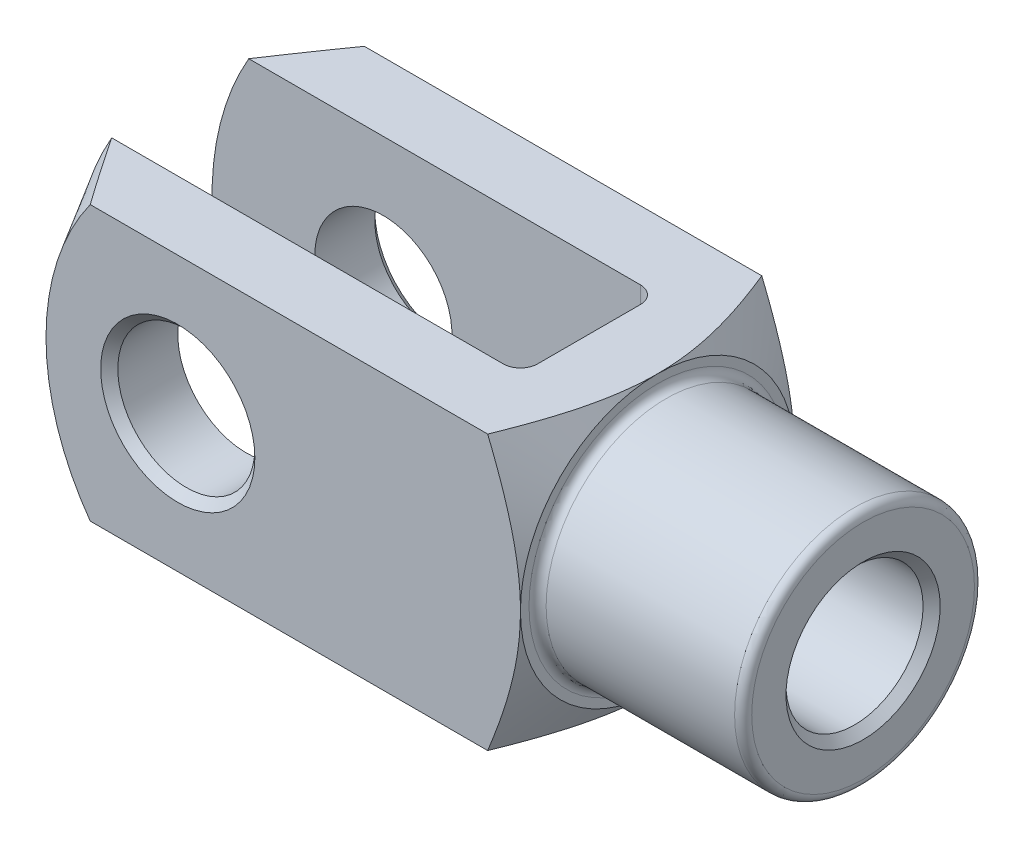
ISO-10303-21;
HEADER;
FILE_DESCRIPTION(('STEP AP214'),'2;1');
FILE_NAME('part.step','',(''),(''),'','','');
FILE_SCHEMA(('AUTOMOTIVE_DESIGN { 1 0 10303 214 1 1 1 1 }'));
ENDSEC;
DATA;
#1=APPLICATION_CONTEXT('core data for automotive mechanical design processes');
#2=APPLICATION_PROTOCOL_DEFINITION('international standard','automotive_design',2000,#1);
#3=PRODUCT_CONTEXT('',#1,'mechanical');
#4=PRODUCT('Part','Part','',(#3));
#5=PRODUCT_RELATED_PRODUCT_CATEGORY('part','',(#4));
#6=PRODUCT_DEFINITION_FORMATION('','',#4);
#7=PRODUCT_DEFINITION_CONTEXT('part definition',#1,'design');
#8=PRODUCT_DEFINITION('design','',#6,#7);
#9=PRODUCT_DEFINITION_SHAPE('','',#8);
#10=(LENGTH_UNIT() NAMED_UNIT(*) SI_UNIT(.MILLI.,.METRE.));
#11=(NAMED_UNIT(*) PLANE_ANGLE_UNIT() SI_UNIT($,.RADIAN.));
#12=(NAMED_UNIT(*) SI_UNIT($,.STERADIAN.) SOLID_ANGLE_UNIT());
#13=UNCERTAINTY_MEASURE_WITH_UNIT(LENGTH_MEASURE(1.E-05),#10,'distance_accuracy_value','');
#14=(GEOMETRIC_REPRESENTATION_CONTEXT(3) GLOBAL_UNCERTAINTY_ASSIGNED_CONTEXT((#13)) GLOBAL_UNIT_ASSIGNED_CONTEXT((#10,
#11,#12)) REPRESENTATION_CONTEXT('',''));
#15=CARTESIAN_POINT('',(0.,0.,0.));
#16=DIRECTION('',(0.,0.,1.));
#17=DIRECTION('',(1.,0.,0.));
#18=AXIS2_PLACEMENT_3D('',#15,#16,#17);
#19=CARTESIAN_POINT('',(-17.,-8.,-2.99999999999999));
#20=DIRECTION('',(0.,-1.,0.));
#21=DIRECTION('',(0.,0.,-1.));
#22=AXIS2_PLACEMENT_3D('',#19,#20,#21);
#23=CYLINDRICAL_SURFACE('',#22,1.);
#24=DIRECTION('',(0.,1.,0.));
#25=VECTOR('',#24,1.);
#26=CARTESIAN_POINT('',(-16.,-8.,-2.99999999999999));
#27=LINE('',#26,#25);
#28=CARTESIAN_POINT('',(-16.,-2.6457513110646,-2.99999999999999));
#29=VERTEX_POINT('',#28);
#30=CARTESIAN_POINT('',(-16.,-8.,-2.99999999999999));
#31=VERTEX_POINT('',#30);
#32=EDGE_CURVE('E357',#29,#31,#27,.F.);
#33=ORIENTED_EDGE('',*,*,#32,.F.);
#34=CARTESIAN_POINT('',(-16.,-2.6457513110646,-2.99999999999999));
#35=CARTESIAN_POINT('',(-16.0000222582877,-2.59691643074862,-3.04308129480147));
#36=CARTESIAN_POINT('',(-16.0027813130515,-2.54706628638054,-3.08491225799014));
#37=CARTESIAN_POINT('',(-16.012996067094,-2.44577843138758,-3.16580783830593));
#38=CARTESIAN_POINT('',(-16.0204427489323,-2.39434394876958,-3.20487760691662));
#39=CARTESIAN_POINT('',(-16.0391856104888,-2.29056221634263,-3.27984708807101));
#40=CARTESIAN_POINT('',(-16.0504501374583,-2.23822572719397,-3.31576990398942));
#41=CARTESIAN_POINT('',(-16.0762500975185,-2.13245420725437,-3.38476417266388));
#42=CARTESIAN_POINT('',(-16.0907876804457,-2.07901847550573,-3.4178337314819));
#43=CARTESIAN_POINT('',(-16.1314716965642,-1.94128133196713,-3.49869690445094));
#44=CARTESIAN_POINT('',(-16.159576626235,-1.85634962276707,-3.54444475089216));
#45=CARTESIAN_POINT('',(-16.2208922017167,-1.68494910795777,-3.62906229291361));
#46=CARTESIAN_POINT('',(-16.2541046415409,-1.5984797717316,-3.66792956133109));
#47=CARTESIAN_POINT('',(-16.3598954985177,-1.33652816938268,-3.77483346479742));
#48=CARTESIAN_POINT('',(-16.4383939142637,-1.15922544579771,-3.83275455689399));
#49=CARTESIAN_POINT('',(-16.5956023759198,-0.820227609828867,-3.91850936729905));
#50=CARTESIAN_POINT('',(-16.6735122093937,-0.658737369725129,-3.94876568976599));
#51=CARTESIAN_POINT('',(-16.8324153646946,-0.335223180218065,-3.98924683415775));
#52=CARTESIAN_POINT('',(-16.9133996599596,-0.17320190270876,-3.99952627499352));
#53=CARTESIAN_POINT('',(-16.9962288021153,-0.0075424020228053,-3.99999466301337));
#54=CARTESIAN_POINT('',(-16.9981144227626,-0.00377116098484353,-3.99999999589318));
#55=CARTESIAN_POINT('',(-17.,0.,-4.));
#56=B_SPLINE_CURVE_WITH_KNOTS('',3,(#34,#35,#36,#37,#38,#39,#40,#41,#42,#43,#44,#45,#46,#47,#48,
#49,#50,#51,#52,#53,#54,#55),.UNSPECIFIED.,.F.,.F.,(4,2,2,2,2,2,2,2,2,2,4),(0.,
0.195194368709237,0.390014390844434,0.583257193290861,0.776627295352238,1.07759313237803,
1.37866492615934,1.98338003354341,2.52784959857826,3.07082842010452,3.08347754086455),.UNSPECIFIED.);
#57=CARTESIAN_POINT('',(-17.,0.,-4.));
#58=VERTEX_POINT('',#57);
#59=EDGE_CURVE('E389',#29,#58,#56,.T.);
#60=ORIENTED_EDGE('',*,*,#59,.T.);
#61=DIRECTION('',(0.,1.,0.));
#62=VECTOR('',#61,1.);
#63=CARTESIAN_POINT('',(-17.,8.,-3.99999999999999));
#64=LINE('',#63,#62);
#65=CARTESIAN_POINT('',(-17.,-8.,-3.99999999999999));
#66=VERTEX_POINT('',#65);
#67=EDGE_CURVE('E182',#66,#58,#64,.T.);
#68=ORIENTED_EDGE('',*,*,#67,.F.);
#69=CARTESIAN_POINT('',(-17.,-8.,-2.99999999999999));
#70=DIRECTION('',(0.,-1.,0.));
#71=DIRECTION('',(0.,0.,-1.));
#72=AXIS2_PLACEMENT_3D('',#69,#70,#71);
#73=CIRCLE('',#72,1.);
#74=EDGE_CURVE('E197',#31,#66,#73,.F.);
#75=ORIENTED_EDGE('',*,*,#74,.F.);
#76=EDGE_LOOP('',(#33,#60,#68,#75));
#77=FACE_BOUND('',#76,.T.);
#78=ADVANCED_FACE('F37',(#77),#23,.F.);
#79=CARTESIAN_POINT('',(-16.,-8.,-3.99999999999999));
#80=DIRECTION('',(1.,0.,0.));
#81=DIRECTION('',(0.,0.,-1.));
#82=AXIS2_PLACEMENT_3D('',#79,#80,#81);
#83=PLANE('',#82);
#84=CARTESIAN_POINT('',(-16.,8.,-2.99999999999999));
#85=VERTEX_POINT('',#84);
#86=CARTESIAN_POINT('',(-16.,2.6457513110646,-2.99999999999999));
#87=VERTEX_POINT('',#86);
#88=EDGE_CURVE('E373',#85,#87,#27,.F.);
#89=ORIENTED_EDGE('',*,*,#88,.T.);
#90=CARTESIAN_POINT('',(-16.,0.,0.));
#91=DIRECTION('',(1.,0.,0.));
#92=DIRECTION('',(0.,0.,-1.));
#93=AXIS2_PLACEMENT_3D('',#90,#91,#92);
#94=CIRCLE('',#93,4.);
#95=CARTESIAN_POINT('',(-16.,2.6457513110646,2.99999999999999));
#96=VERTEX_POINT('',#95);
#97=EDGE_CURVE('E426',#87,#96,#94,.T.);
#98=ORIENTED_EDGE('',*,*,#97,.T.);
#99=DIRECTION('',(0.,1.,0.));
#100=VECTOR('',#99,1.);
#101=CARTESIAN_POINT('',(-16.,8.,2.99999999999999));
#102=LINE('',#101,#100);
#103=CARTESIAN_POINT('',(-16.,8.,2.99999999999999));
#104=VERTEX_POINT('',#103);
#105=EDGE_CURVE('E160',#96,#104,#102,.T.);
#106=ORIENTED_EDGE('',*,*,#105,.T.);
#107=DIRECTION('',(0.,0.,-1.));
#108=VECTOR('',#107,1.);
#109=CARTESIAN_POINT('',(-16.,8.,-3.99999999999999));
#110=LINE('',#109,#108);
#111=EDGE_CURVE('E337',#104,#85,#110,.T.);
#112=ORIENTED_EDGE('',*,*,#111,.T.);
#113=EDGE_LOOP('',(#89,#98,#106,#112));
#114=FACE_BOUND('',#113,.T.);
#115=ADVANCED_FACE('F469',(#114),#83,.F.);
#116=CARTESIAN_POINT('',(-17.,-8.,2.99999999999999));
#117=DIRECTION('',(0.,-1.,0.));
#118=DIRECTION('',(0.,0.,-1.));
#119=AXIS2_PLACEMENT_3D('',#116,#117,#118);
#120=CYLINDRICAL_SURFACE('',#119,1.);
#121=ORIENTED_EDGE('',*,*,#105,.F.);
#122=CARTESIAN_POINT('',(-16.,2.6457513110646,2.99999999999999));
#123=CARTESIAN_POINT('',(-16.0000222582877,2.59691643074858,3.0430812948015));
#124=CARTESIAN_POINT('',(-16.0027813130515,2.54706628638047,3.0849122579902));
#125=CARTESIAN_POINT('',(-16.012996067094,2.44577843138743,3.16580783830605));
#126=CARTESIAN_POINT('',(-16.0204427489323,2.39434394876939,3.20487760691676));
#127=CARTESIAN_POINT('',(-16.0391856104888,2.29056221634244,3.27984708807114));
#128=CARTESIAN_POINT('',(-16.0504501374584,2.23822572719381,3.31576990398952));
#129=CARTESIAN_POINT('',(-16.0762500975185,2.13245420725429,3.38476417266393));
#130=CARTESIAN_POINT('',(-16.0907876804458,2.07901847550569,3.41783373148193));
#131=CARTESIAN_POINT('',(-16.1314716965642,1.94128133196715,3.49869690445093));
#132=CARTESIAN_POINT('',(-16.159576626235,1.85634962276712,3.54444475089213));
#133=CARTESIAN_POINT('',(-16.2208922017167,1.68494910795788,3.62906229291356));
#134=CARTESIAN_POINT('',(-16.2541046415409,1.59847977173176,3.66792956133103));
#135=CARTESIAN_POINT('',(-16.3598954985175,1.33652816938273,3.77483346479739));
#136=CARTESIAN_POINT('',(-16.4383939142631,1.15922544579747,3.83275455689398));
#137=CARTESIAN_POINT('',(-16.5956023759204,0.820227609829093,3.91850936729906));
#138=CARTESIAN_POINT('',(-16.6735122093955,0.658737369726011,3.948765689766));
#139=CARTESIAN_POINT('',(-16.8324153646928,0.335223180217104,3.98924683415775));
#140=CARTESIAN_POINT('',(-16.9133996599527,0.17320190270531,3.99952627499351));
#141=CARTESIAN_POINT('',(-16.996228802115,0.00754240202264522,3.99999466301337));
#142=CARTESIAN_POINT('',(-16.9981144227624,0.0037711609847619,3.99999999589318));
#143=CARTESIAN_POINT('',(-17.,0.,4.));
#144=B_SPLINE_CURVE_WITH_KNOTS('',3,(#122,#123,#124,#125,#126,#127,#128,#129,#130,#131,#132,
#133,#134,#135,#136,#137,#138,#139,#140,#141,#142,#143),.UNSPECIFIED.,.F.,.F.,(4,2,2,2,2,2,2,2,
2,2,4),(0.,0.195194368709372,0.390014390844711,0.583257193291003,0.77662729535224,
1.07759313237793,1.37866492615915,1.98338003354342,2.5278495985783,3.07082842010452,
3.08347754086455),.UNSPECIFIED.);
#145=CARTESIAN_POINT('',(-17.,0.,4.));
#146=VERTEX_POINT('',#145);
#147=EDGE_CURVE('E145',#96,#146,#144,.T.);
#148=ORIENTED_EDGE('',*,*,#147,.T.);
#149=DIRECTION('',(0.,1.,0.));
#150=VECTOR('',#149,1.);
#151=CARTESIAN_POINT('',(-17.,-8.,3.99999999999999));
#152=LINE('',#151,#150);
#153=CARTESIAN_POINT('',(-17.,8.,3.99999999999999));
#154=VERTEX_POINT('',#153);
#155=EDGE_CURVE('E159',#154,#146,#152,.F.);
#156=ORIENTED_EDGE('',*,*,#155,.F.);
#157=CARTESIAN_POINT('',(-17.,8.,2.99999999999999));
#158=DIRECTION('',(0.,1.,0.));
#159=DIRECTION('',(0.,0.,1.));
#160=AXIS2_PLACEMENT_3D('',#157,#158,#159);
#161=CIRCLE('',#160,1.);
#162=EDGE_CURVE('E189',#104,#154,#161,.F.);
#163=ORIENTED_EDGE('',*,*,#162,.F.);
#164=EDGE_LOOP('',(#121,#148,#156,#163));
#165=FACE_BOUND('',#164,.T.);
#166=ADVANCED_FACE('F156',(#165),#120,.F.);
#167=CARTESIAN_POINT('',(-42.,-8.,-3.99999999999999));
#168=DIRECTION('',(0.,0.,-1.));
#169=DIRECTION('',(-1.,0.,0.));
#170=AXIS2_PLACEMENT_3D('',#167,#168,#169);
#171=PLANE('',#170);
#172=CARTESIAN_POINT('',(-32.,0.,-3.99999999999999));
#173=DIRECTION('',(0.,0.,-1.));
#174=DIRECTION('',(-1.,0.,0.));
#175=AXIS2_PLACEMENT_3D('',#172,#173,#174);
#176=CIRCLE('',#175,4.);
#177=CARTESIAN_POINT('',(-36.,0.,-3.99999999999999));
#178=VERTEX_POINT('',#177);
#179=EDGE_CURVE('E367',#178,#178,#176,.F.);
#180=ORIENTED_EDGE('',*,*,#179,.F.);
#181=EDGE_LOOP('',(#180));
#182=FACE_BOUND('',#181,.T.);
#183=CARTESIAN_POINT('',(-26.,0.,-3.99999999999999));
#184=DIRECTION('',(0.,0.,1.));
#185=DIRECTION('',(1.,0.,0.));
#186=AXIS2_PLACEMENT_3D('',#183,#184,#185);
#187=CIRCLE('',#186,16.);
#188=CARTESIAN_POINT('',(-39.856406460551,8.,-3.99999999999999));
#189=VERTEX_POINT('',#188);
#190=CARTESIAN_POINT('',(-39.856406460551,-8.,-3.99999999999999));
#191=VERTEX_POINT('',#190);
#192=EDGE_CURVE('E275',#189,#191,#187,.T.);
#193=ORIENTED_EDGE('',*,*,#192,.T.);
#194=DIRECTION('',(-1.,0.,0.));
#195=VECTOR('',#194,1.);
#196=CARTESIAN_POINT('',(-42.,-8.,-3.99999999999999));
#197=LINE('',#196,#195);
#198=EDGE_CURVE('E332',#66,#191,#197,.T.);
#199=ORIENTED_EDGE('',*,*,#198,.F.);
#200=ORIENTED_EDGE('',*,*,#67,.T.);
#201=CARTESIAN_POINT('',(-17.,8.,-3.99999999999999));
#202=VERTEX_POINT('',#201);
#203=EDGE_CURVE('E179',#58,#202,#64,.T.);
#204=ORIENTED_EDGE('',*,*,#203,.T.);
#205=DIRECTION('',(-1.,0.,0.));
#206=VECTOR('',#205,1.);
#207=CARTESIAN_POINT('',(-42.,8.,-3.99999999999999));
#208=LINE('',#207,#206);
#209=EDGE_CURVE('E345',#202,#189,#208,.T.);
#210=ORIENTED_EDGE('',*,*,#209,.T.);
#211=EDGE_LOOP('',(#193,#199,#200,#204,#210));
#212=FACE_BOUND('',#211,.T.);
#213=ADVANCED_FACE('F392',(#182,#212),#171,.F.);
#214=CARTESIAN_POINT('',(-42.,-8.,4.));
#215=DIRECTION('',(0.,0.,1.));
#216=DIRECTION('',(1.,0.,0.));
#217=AXIS2_PLACEMENT_3D('',#214,#215,#216);
#218=PLANE('',#217);
#219=CARTESIAN_POINT('',(-32.,0.,4.));
#220=DIRECTION('',(0.,0.,1.));
#221=DIRECTION('',(1.,0.,0.));
#222=AXIS2_PLACEMENT_3D('',#219,#220,#221);
#223=CIRCLE('',#222,4.);
#224=CARTESIAN_POINT('',(-28.,0.,4.));
#225=VERTEX_POINT('',#224);
#226=EDGE_CURVE('E344',#225,#225,#223,.F.);
#227=ORIENTED_EDGE('',*,*,#226,.F.);
#228=EDGE_LOOP('',(#227));
#229=FACE_BOUND('',#228,.T.);
#230=DIRECTION('',(1.,0.,0.));
#231=VECTOR('',#230,1.);
#232=CARTESIAN_POINT('',(-42.,-8.,4.));
#233=LINE('',#232,#231);
#234=CARTESIAN_POINT('',(-39.856406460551,-8.,4.));
#235=VERTEX_POINT('',#234);
#236=CARTESIAN_POINT('',(-17.,-8.,3.99999999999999));
#237=VERTEX_POINT('',#236);
#238=EDGE_CURVE('E336',#235,#237,#233,.T.);
#239=ORIENTED_EDGE('',*,*,#238,.F.);
#240=CARTESIAN_POINT('',(-26.,0.,4.));
#241=DIRECTION('',(0.,0.,1.));
#242=DIRECTION('',(1.,0.,0.));
#243=AXIS2_PLACEMENT_3D('',#240,#241,#242);
#244=CIRCLE('',#243,16.);
#245=CARTESIAN_POINT('',(-39.856406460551,8.,4.));
#246=VERTEX_POINT('',#245);
#247=EDGE_CURVE('E417',#246,#235,#244,.T.);
#248=ORIENTED_EDGE('',*,*,#247,.F.);
#249=DIRECTION('',(1.,0.,0.));
#250=VECTOR('',#249,1.);
#251=CARTESIAN_POINT('',(-42.,8.,4.));
#252=LINE('',#251,#250);
#253=EDGE_CURVE('E176',#246,#154,#252,.T.);
#254=ORIENTED_EDGE('',*,*,#253,.T.);
#255=ORIENTED_EDGE('',*,*,#155,.T.);
#256=EDGE_CURVE('E164',#146,#237,#152,.F.);
#257=ORIENTED_EDGE('',*,*,#256,.T.);
#258=EDGE_LOOP('',(#239,#248,#254,#255,#257));
#259=FACE_BOUND('',#258,.T.);
#260=ADVANCED_FACE('F173',(#229,#259),#218,.F.);
#261=CARTESIAN_POINT('',(-42.,-8.,8.));
#262=DIRECTION('',(0.,0.,1.));
#263=DIRECTION('',(1.,0.,0.));
#264=AXIS2_PLACEMENT_3D('',#261,#262,#263);
#265=PLANE('',#264);
#266=CARTESIAN_POINT('',(-32.,0.,8.));
#267=DIRECTION('',(0.,0.,1.));
#268=DIRECTION('',(1.,0.,0.));
#269=AXIS2_PLACEMENT_3D('',#266,#267,#268);
#270=CIRCLE('',#269,4.49999999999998);
#271=CARTESIAN_POINT('',(-27.5,0.,8.));
#272=VERTEX_POINT('',#271);
#273=EDGE_CURVE('E227',#272,#272,#270,.F.);
#274=ORIENTED_EDGE('',*,*,#273,.T.);
#275=EDGE_LOOP('',(#274));
#276=FACE_BOUND('',#275,.T.);
#277=DIRECTION('',(1.,0.,0.));
#278=VECTOR('',#277,1.);
#279=CARTESIAN_POINT('',(-42.,8.,8.));
#280=LINE('',#279,#278);
#281=CARTESIAN_POINT('',(-37.1100179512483,8.,8.));
#282=VERTEX_POINT('',#281);
#283=CARTESIAN_POINT('',(-13.9131704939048,8.,8.));
#284=VERTEX_POINT('',#283);
#285=EDGE_CURVE('E364',#282,#284,#280,.T.);
#286=ORIENTED_EDGE('',*,*,#285,.F.);
#287=CARTESIAN_POINT('',(-26.,0.,8.));
#288=DIRECTION('',(0.,0.,1.));
#289=DIRECTION('',(1.,0.,0.));
#290=AXIS2_PLACEMENT_3D('',#287,#288,#289);
#291=CIRCLE('',#290,13.6905989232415);
#292=CARTESIAN_POINT('',(-37.1100179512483,-8.,8.));
#293=VERTEX_POINT('',#292);
#294=EDGE_CURVE('E61',#282,#293,#291,.T.);
#295=ORIENTED_EDGE('',*,*,#294,.T.);
#296=DIRECTION('',(1.,0.,0.));
#297=VECTOR('',#296,1.);
#298=CARTESIAN_POINT('',(-42.,-8.,8.));
#299=LINE('',#298,#297);
#300=CARTESIAN_POINT('',(-13.9131704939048,-8.,8.));
#301=VERTEX_POINT('',#300);
#302=EDGE_CURVE('E361',#293,#301,#299,.T.);
#303=ORIENTED_EDGE('',*,*,#302,.T.);
#304=CARTESIAN_POINT('',(-17.8846987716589,-16.3392348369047,8.));
#305=CARTESIAN_POINT('',(-17.6802772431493,-15.9449469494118,8.));
#306=CARTESIAN_POINT('',(-17.4769364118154,-15.550093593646,8.));
#307=CARTESIAN_POINT('',(-17.0729892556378,-14.7589649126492,8.));
#308=CARTESIAN_POINT('',(-16.8723830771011,-14.3626895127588,8.));
#309=CARTESIAN_POINT('',(-16.474153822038,-13.56777616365,8.));
#310=CARTESIAN_POINT('',(-16.2765365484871,-13.1691353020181,8.));
#311=CARTESIAN_POINT('',(-15.88546114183,-12.3698241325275,8.));
#312=CARTESIAN_POINT('',(-15.6920029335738,-11.9691538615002,8.));
#313=CARTESIAN_POINT('',(-15.2985635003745,-11.1406012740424,8.));
#314=CARTESIAN_POINT('',(-15.0989132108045,-10.7125613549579,8.));
#315=CARTESIAN_POINT('',(-14.7072115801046,-9.85297670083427,8.));
#316=CARTESIAN_POINT('',(-14.5151606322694,-9.42143178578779,8.));
#317=CARTESIAN_POINT('',(-14.1411578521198,-8.55419814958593,8.));
#318=CARTESIAN_POINT('',(-13.959201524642,-8.11851137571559,8.));
#319=CARTESIAN_POINT('',(-13.6086480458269,-7.24179288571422,8.));
#320=CARTESIAN_POINT('',(-13.4400493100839,-6.80076181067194,8.));
#321=CARTESIAN_POINT('',(-13.1834024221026,-6.08615976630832,8.));
#322=CARTESIAN_POINT('',(-13.0896630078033,-5.81463561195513,8.));
#323=CARTESIAN_POINT('',(-12.9102546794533,-5.2689424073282,8.));
#324=CARTESIAN_POINT('',(-12.8245850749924,-4.99477358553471,8.));
#325=CARTESIAN_POINT('',(-12.6629013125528,-4.44359021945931,8.));
#326=CARTESIAN_POINT('',(-12.5868869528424,-4.16657573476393,8.));
#327=CARTESIAN_POINT('',(-12.4463305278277,-3.60962774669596,8.));
#328=CARTESIAN_POINT('',(-12.3817883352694,-3.32969427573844,8.));
#329=CARTESIAN_POINT('',(-12.267479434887,-2.77364565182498,8.));
#330=CARTESIAN_POINT('',(-12.2174014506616,-2.49759512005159,8.));
#331=CARTESIAN_POINT('',(-12.1318063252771,-1.94322662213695,8.));
#332=CARTESIAN_POINT('',(-12.0962887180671,-1.66490872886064,8.));
#333=CARTESIAN_POINT('',(-12.0412989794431,-1.10685523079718,8.));
#334=CARTESIAN_POINT('',(-12.0218163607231,-0.827120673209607,8.));
#335=CARTESIAN_POINT('',(-11.9997560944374,-0.266983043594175,8.));
#336=CARTESIAN_POINT('',(-11.9971778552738,0.013420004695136,8.));
#337=CARTESIAN_POINT('',(-12.0086102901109,0.553432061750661,8.));
#338=CARTESIAN_POINT('',(-12.0214258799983,0.813067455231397,8.));
#339=CARTESIAN_POINT('',(-12.0611642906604,1.3312448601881,8.));
#340=CARTESIAN_POINT('',(-12.0880870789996,1.5897868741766,8.));
#341=CARTESIAN_POINT('',(-12.155052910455,2.10528244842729,8.));
#342=CARTESIAN_POINT('',(-12.195102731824,2.36223511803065,8.));
#343=CARTESIAN_POINT('',(-12.2870021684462,2.87400792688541,8.));
#344=CARTESIAN_POINT('',(-12.3388521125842,3.12882800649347,8.));
#345=CARTESIAN_POINT('',(-12.4545600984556,3.6434629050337,8.));
#346=CARTESIAN_POINT('',(-12.518722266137,3.90320881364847,8.));
#347=CARTESIAN_POINT('',(-12.6564654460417,4.42017468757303,8.));
#348=CARTESIAN_POINT('',(-12.7300465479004,4.67739462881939,8.));
#349=CARTESIAN_POINT('',(-12.8852035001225,5.18938513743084,8.));
#350=CARTESIAN_POINT('',(-12.9667789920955,5.44415581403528,8.));
#351=CARTESIAN_POINT('',(-13.1366771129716,5.95141147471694,8.));
#352=CARTESIAN_POINT('',(-13.224999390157,6.20389657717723,8.));
#353=CARTESIAN_POINT('',(-13.4147611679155,6.7272922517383,8.));
#354=CARTESIAN_POINT('',(-13.5166830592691,6.99802735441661,8.));
#355=CARTESIAN_POINT('',(-13.7260618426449,7.53735530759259,8.));
#356=CARTESIAN_POINT('',(-13.8335190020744,7.80594805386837,8.));
#357=CARTESIAN_POINT('',(-14.0530704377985,8.34129271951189,8.));
#358=CARTESIAN_POINT('',(-14.1651656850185,8.60804423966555,8.));
#359=CARTESIAN_POINT('',(-14.3932328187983,9.13988748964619,8.));
#360=CARTESIAN_POINT('',(-14.5092047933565,9.40497918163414,8.));
#361=CARTESIAN_POINT('',(-14.8621889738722,10.1985259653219,8.));
#362=CARTESIAN_POINT('',(-15.1040848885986,10.7248088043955,8.));
#363=CARTESIAN_POINT('',(-15.5972155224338,11.7728810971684,8.));
#364=CARTESIAN_POINT('',(-15.8484492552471,12.2946710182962,8.));
#365=CARTESIAN_POINT('',(-16.3586491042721,13.3364224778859,8.));
#366=CARTESIAN_POINT('',(-16.6176364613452,13.8563735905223,8.));
#367=CARTESIAN_POINT('',(-17.1409123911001,14.8936090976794,8.));
#368=CARTESIAN_POINT('',(-17.4052010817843,15.4108934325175,8.));
#369=CARTESIAN_POINT('',(-17.9377393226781,16.4430931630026,8.));
#370=CARTESIAN_POINT('',(-18.2059868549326,16.9580096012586,8.));
#371=CARTESIAN_POINT('',(-18.7457004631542,17.9861456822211,8.));
#372=CARTESIAN_POINT('',(-19.0171665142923,18.4993653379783,8.));
#373=CARTESIAN_POINT('',(-19.754394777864,19.8847467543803,8.));
#374=CARTESIAN_POINT('',(-20.2225895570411,20.7556134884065,8.));
#375=CARTESIAN_POINT('',(-21.164259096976,22.494640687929,8.));
#376=CARTESIAN_POINT('',(-21.6377345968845,23.3628007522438,8.));
#377=CARTESIAN_POINT('',(-22.5857843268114,25.0920581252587,8.));
#378=CARTESIAN_POINT('',(-23.0603367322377,25.9531674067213,8.));
#379=CARTESIAN_POINT('',(-23.7742624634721,27.2435811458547,8.));
#380=CARTESIAN_POINT('',(-24.0125683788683,27.6734768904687,8.));
#381=CARTESIAN_POINT('',(-24.4898082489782,28.5329190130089,8.));
#382=CARTESIAN_POINT('',(-24.7287422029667,28.9624653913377,8.));
#383=CARTESIAN_POINT('',(-24.9679488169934,29.3918599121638,8.));
#384=B_SPLINE_CURVE_WITH_KNOTS('',3,(#304,#305,#306,#307,#308,#309,#310,#311,#312,#313,#314,
#315,#316,#317,#318,#319,#320,#321,#322,#323,#324,#325,#326,#327,#328,#329,#330,#331,#332,#333,
#334,#335,#336,#337,#338,#339,#340,#341,#342,#343,#344,#345,#346,#347,#348,#349,#350,#351,#352,
#353,#354,#355,#356,#357,#358,#359,#360,#361,#362,#363,#364,#365,#366,#367,#368,#369,#370,#371,
#372,#373,#374,#375,#376,#377,#378,#379,#380,#381,#382,#383),.UNSPECIFIED.,.F.,.F.,(4,2,2,2,2,2,
2,2,2,2,2,2,2,2,2,2,2,2,2,2,2,2,2,2,2,2,2,2,2,2,2,2,2,2,2,2,2,2,2,4),(0.,1.33239397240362,
2.66485895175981,3.99964423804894,5.33440538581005,6.7512847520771,8.16823735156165,
9.58455382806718,11.0007020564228,11.8623516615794,12.7239274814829,13.5854852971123,
14.4470335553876,15.2883577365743,16.1296549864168,16.9704015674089,17.8111187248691,
18.590575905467,19.3700312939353,20.1498897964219,20.9297700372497,21.732223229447,
22.5346840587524,23.3371089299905,24.139491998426,25.0072719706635,25.8750939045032,
26.7430984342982,27.6111226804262,29.3486130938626,31.085920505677,32.8285250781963,
34.5711684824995,36.3129523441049,38.0547227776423,41.0209268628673,43.9875514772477,
46.9371849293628,48.4117694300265,49.8863522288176),.UNSPECIFIED.);
#385=CARTESIAN_POINT('',(-12.,0.,8.));
#386=VERTEX_POINT('',#385);
#387=EDGE_CURVE('E304',#386,#301,#384,.F.);
#388=ORIENTED_EDGE('',*,*,#387,.F.);
#389=EDGE_CURVE('E302',#284,#386,#384,.F.);
#390=ORIENTED_EDGE('',*,*,#389,.F.);
#391=EDGE_LOOP('',(#286,#295,#303,#388,#390));
#392=FACE_BOUND('',#391,.T.);
#393=ADVANCED_FACE('F286',(#276,#392),#265,.T.);
#394=CARTESIAN_POINT('',(-42.,-8.,8.));
#395=DIRECTION('',(0.,-1.,0.));
#396=DIRECTION('',(0.,0.,-1.));
#397=AXIS2_PLACEMENT_3D('',#394,#395,#396);
#398=PLANE('',#397);
#399=ORIENTED_EDGE('',*,*,#198,.T.);
#400=CARTESIAN_POINT('',(-46.1857767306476,-8.,5.89565350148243));
#401=CARTESIAN_POINT('',(-45.7965292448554,-8.,5.26892979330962));
#402=CARTESIAN_POINT('',(-45.4062157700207,-8.,4.64286516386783));
#403=CARTESIAN_POINT('',(-44.6229580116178,-8.,3.3923666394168));
#404=CARTESIAN_POINT('',(-44.230013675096,-8.,2.76793277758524));
#405=CARTESIAN_POINT('',(-43.4405400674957,-8.,1.52028939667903));
#406=CARTESIAN_POINT('',(-43.0440070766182,-8.,0.897082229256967));
#407=CARTESIAN_POINT('',(-42.2471530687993,-8.,-0.3468998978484));
#408=CARTESIAN_POINT('',(-41.8468320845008,-8.,-0.967674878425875));
#409=CARTESIAN_POINT('',(-41.0247666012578,-8.,-2.23198790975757));
#410=CARTESIAN_POINT('',(-40.6028241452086,-8.,-2.87539744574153));
#411=CARTESIAN_POINT('',(-39.7525673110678,-8.,-4.15798891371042));
#412=CARTESIAN_POINT('',(-39.3242529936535,-8.,-4.79717088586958));
#413=CARTESIAN_POINT('',(-38.4597392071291,-8.,-6.06950936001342));
#414=CARTESIAN_POINT('',(-38.0235458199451,-8.,-6.70266997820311));
#415=CARTESIAN_POINT('',(-37.36112336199,-8.,-7.64668569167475));
#416=CARTESIAN_POINT('',(-37.1389647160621,-8.,-7.96039757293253));
#417=CARTESIAN_POINT('',(-36.6914753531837,-8.,-8.58554886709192));
#418=CARTESIAN_POINT('',(-36.4661446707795,-8.,-8.89698830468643));
#419=CARTESIAN_POINT('',(-36.0138777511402,-8.,-9.51426261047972));
#420=CARTESIAN_POINT('',(-35.7869759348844,-8.,-9.82012266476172));
#421=CARTESIAN_POINT('',(-35.3288611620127,-8.,-10.428591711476));
#422=CARTESIAN_POINT('',(-35.0976483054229,-8.,-10.7312007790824));
#423=CARTESIAN_POINT('',(-34.6297403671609,-8.,-11.3328374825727));
#424=CARTESIAN_POINT('',(-34.3930380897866,-8.,-11.6318595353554));
#425=CARTESIAN_POINT('',(-33.9133962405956,-8.,-12.2248466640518));
#426=CARTESIAN_POINT('',(-33.6704570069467,-8.,-12.5188120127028));
#427=CARTESIAN_POINT('',(-33.1794855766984,-8.,-13.0972598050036));
#428=CARTESIAN_POINT('',(-32.9315323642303,-8.,-13.381808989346));
#429=CARTESIAN_POINT('',(-32.4262856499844,-8.,-13.9426547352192));
#430=CARTESIAN_POINT('',(-32.1689897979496,-8.,-14.2189491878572));
#431=CARTESIAN_POINT('',(-31.6433260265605,-8.,-14.7597258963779));
#432=CARTESIAN_POINT('',(-31.3749843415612,-8.,-15.0242333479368));
#433=CARTESIAN_POINT('',(-30.9615433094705,-8.,-15.4091163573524));
#434=CARTESIAN_POINT('',(-30.8219428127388,-8.,-15.5354022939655));
#435=CARTESIAN_POINT('',(-30.5385996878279,-8.,-15.7832263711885));
#436=CARTESIAN_POINT('',(-30.3948575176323,-8.,-15.9047650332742));
#437=CARTESIAN_POINT('',(-30.0975226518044,-8.,-16.1463249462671));
#438=CARTESIAN_POINT('',(-29.9437613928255,-8.,-16.2661397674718));
#439=CARTESIAN_POINT('',(-29.6305832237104,-8.,-16.498238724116));
#440=CARTESIAN_POINT('',(-29.4711652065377,-8.,-16.610521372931));
#441=CARTESIAN_POINT('',(-29.1461892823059,-8.,-16.8256372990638));
#442=CARTESIAN_POINT('',(-28.9806363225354,-8.,-16.928477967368));
#443=CARTESIAN_POINT('',(-28.6428904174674,-8.,-17.1224621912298));
#444=CARTESIAN_POINT('',(-28.4706992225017,-8.,-17.2136088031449));
#445=CARTESIAN_POINT('',(-28.02365757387,-8.,-17.4270731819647));
#446=CARTESIAN_POINT('',(-27.7438013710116,-8.,-17.5394682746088));
#447=CARTESIAN_POINT('',(-27.3134448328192,-8.,-17.6730277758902));
#448=CARTESIAN_POINT('',(-27.1682897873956,-8.,-17.7117004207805));
#449=CARTESIAN_POINT('',(-26.8750748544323,-8.,-17.7760297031));
#450=CARTESIAN_POINT('',(-26.7270150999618,-8.,-17.801686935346));
#451=CARTESIAN_POINT('',(-26.4276254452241,-8.,-17.8390585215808));
#452=CARTESIAN_POINT('',(-26.2762776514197,-8.,-17.8506309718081));
#453=CARTESIAN_POINT('',(-25.9731780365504,-8.,-17.8588139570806));
#454=CARTESIAN_POINT('',(-25.8214262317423,-8.,-17.855425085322));
#455=CARTESIAN_POINT('',(-25.5189603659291,-8.,-17.8338479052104));
#456=CARTESIAN_POINT('',(-25.3682465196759,-8.,-17.8156566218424));
#457=CARTESIAN_POINT('',(-25.0691796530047,-8.,-17.7653124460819));
#458=CARTESIAN_POINT('',(-24.9208270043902,-8.,-17.733157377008));
#459=CARTESIAN_POINT('',(-24.6002883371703,-8.,-17.6490655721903));
#460=CARTESIAN_POINT('',(-24.4287768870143,-8.,-17.5945681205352));
#461=CARTESIAN_POINT('',(-24.0913326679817,-8.,-17.47036463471));
#462=CARTESIAN_POINT('',(-23.9254030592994,-8.,-17.400650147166));
#463=CARTESIAN_POINT('',(-23.5990125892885,-8.,-17.2483781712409));
#464=CARTESIAN_POINT('',(-23.4385691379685,-8.,-17.1657837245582));
#465=CARTESIAN_POINT('',(-23.1235514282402,-8.,-16.9902060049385));
#466=CARTESIAN_POINT('',(-22.9689765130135,-8.,-16.897223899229));
#467=CARTESIAN_POINT('',(-22.6154702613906,-8.,-16.670882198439));
#468=CARTESIAN_POINT('',(-22.4186208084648,-8.,-16.5342825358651));
#469=CARTESIAN_POINT('',(-22.0333734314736,-8.,-16.2495879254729));
#470=CARTESIAN_POINT('',(-21.8449795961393,-8.,-16.1014875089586));
#471=CARTESIAN_POINT('',(-21.4752188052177,-8.,-15.7961052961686));
#472=CARTESIAN_POINT('',(-21.2938660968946,-8.,-15.6388063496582));
#473=CARTESIAN_POINT('',(-20.9375595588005,-8.,-15.3172162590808));
#474=CARTESIAN_POINT('',(-20.7626046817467,-8.,-15.1529262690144));
#475=CARTESIAN_POINT('',(-20.4170062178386,-8.,-14.8176183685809));
#476=CARTESIAN_POINT('',(-20.2463993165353,-8.,-14.6465627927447));
#477=CARTESIAN_POINT('',(-19.9099413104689,-8.,-14.2998402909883));
#478=CARTESIAN_POINT('',(-19.7440903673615,-8.,-14.1241732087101));
#479=CARTESIAN_POINT('',(-19.4166747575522,-8.,-13.7692439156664));
#480=CARTESIAN_POINT('',(-19.2551057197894,-8.,-13.5899857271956));
#481=CARTESIAN_POINT('',(-18.9355274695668,-8.,-13.2283206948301));
#482=CARTESIAN_POINT('',(-18.7775183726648,-8.,-13.0459137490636));
#483=CARTESIAN_POINT('',(-18.3998299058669,-8.,-12.6023889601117));
#484=CARTESIAN_POINT('',(-18.1817025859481,-8.,-12.339950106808));
#485=CARTESIAN_POINT('',(-17.7505813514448,-8.,-11.8108173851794));
#486=CARTESIAN_POINT('',(-17.5375884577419,-8.,-11.5441226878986));
#487=CARTESIAN_POINT('',(-17.1191841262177,-8.,-11.0114334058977));
#488=CARTESIAN_POINT('',(-16.9137065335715,-8.,-10.7454906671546));
#489=CARTESIAN_POINT('',(-16.506432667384,-8.,-10.2109265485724));
#490=CARTESIAN_POINT('',(-16.3046352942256,-8.,-9.94230600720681));
#491=CARTESIAN_POINT('',(-16.1043464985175,-8.,-9.67257983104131));
#492=B_SPLINE_CURVE_WITH_KNOTS('',3,(#400,#401,#402,#403,#404,#405,#406,#407,#408,#409,#410,
#411,#412,#413,#414,#415,#416,#417,#418,#419,#420,#421,#422,#423,#424,#425,#426,#427,#428,#429,
#430,#431,#432,#433,#434,#435,#436,#437,#438,#439,#440,#441,#442,#443,#444,#445,#446,#447,#448,
#449,#450,#451,#452,#453,#454,#455,#456,#457,#458,#459,#460,#461,#462,#463,#464,#465,#466,#467,
#468,#469,#470,#471,#472,#473,#474,#475,#476,#477,#478,#479,#480,#481,#482,#483,#484,#485,#486,
#487,#488,#489,#490,#491),.UNSPECIFIED.,.F.,.F.,(4,2,2,2,2,2,2,2,2,2,2,2,2,2,2,2,2,2,2,2,2,2,2,
2,2,2,2,2,2,2,2,2,2,2,2,2,2,2,2,2,2,2,2,2,2,4),(0.,2.21329571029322,4.42663610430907,
6.64261887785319,8.85858257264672,11.1668200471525,13.4750355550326,15.7815396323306,
16.9347484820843,18.0879447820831,19.2304162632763,20.372861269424,21.5168995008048,
22.6608758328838,23.7929840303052,24.9253790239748,26.0552243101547,26.6198776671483,
27.1844688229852,27.7690691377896,28.3537844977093,28.9380381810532,29.5221388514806,
30.4231831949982,30.8733513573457,31.3234989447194,31.7781451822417,32.2327733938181,
32.687492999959,33.1422835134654,33.6813034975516,34.2206236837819,34.761520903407,
35.3023574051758,36.0205977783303,36.739181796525,37.4591511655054,38.1790021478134,
38.903670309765,39.6283630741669,40.3522850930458,41.0762305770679,42.0999043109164,
43.1237799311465,44.1319728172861,45.1398593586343),.UNSPECIFIED.);
#493=CARTESIAN_POINT('',(-37.1100179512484,-8.,-8.));
#494=VERTEX_POINT('',#493);
#495=EDGE_CURVE('E274',#191,#494,#492,.T.);
#496=ORIENTED_EDGE('',*,*,#495,.T.);
#497=DIRECTION('',(1.,0.,0.));
#498=VECTOR('',#497,1.);
#499=CARTESIAN_POINT('',(-42.,-8.,-8.));
#500=LINE('',#499,#498);
#501=CARTESIAN_POINT('',(-13.9131704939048,-8.,-8.));
#502=VERTEX_POINT('',#501);
#503=EDGE_CURVE('E358',#494,#502,#500,.T.);
#504=ORIENTED_EDGE('',*,*,#503,.T.);
#505=CARTESIAN_POINT('',(-17.8846987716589,-8.,-16.3392348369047));
#506=CARTESIAN_POINT('',(-17.6802772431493,-8.,-15.9449469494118));
#507=CARTESIAN_POINT('',(-17.4769364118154,-8.,-15.550093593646));
#508=CARTESIAN_POINT('',(-17.0729892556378,-8.,-14.7589649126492));
#509=CARTESIAN_POINT('',(-16.8723830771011,-8.,-14.3626895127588));
#510=CARTESIAN_POINT('',(-16.474153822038,-8.,-13.56777616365));
#511=CARTESIAN_POINT('',(-16.2765365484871,-8.,-13.1691353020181));
#512=CARTESIAN_POINT('',(-15.88546114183,-8.,-12.3698241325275));
#513=CARTESIAN_POINT('',(-15.6920029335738,-8.,-11.9691538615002));
#514=CARTESIAN_POINT('',(-15.2985635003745,-8.,-11.1406012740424));
#515=CARTESIAN_POINT('',(-15.0989132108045,-8.,-10.7125613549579));
#516=CARTESIAN_POINT('',(-14.7072115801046,-8.,-9.85297670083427));
#517=CARTESIAN_POINT('',(-14.5151606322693,-8.,-9.42143178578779));
#518=CARTESIAN_POINT('',(-14.1411578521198,-8.,-8.55419814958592));
#519=CARTESIAN_POINT('',(-13.959201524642,-8.,-8.11851137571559));
#520=CARTESIAN_POINT('',(-13.6086480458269,-8.,-7.24179288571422));
#521=CARTESIAN_POINT('',(-13.4400493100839,-8.,-6.80076181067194));
#522=CARTESIAN_POINT('',(-13.1834024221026,-8.,-6.08615976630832));
#523=CARTESIAN_POINT('',(-13.0896630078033,-8.,-5.81463561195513));
#524=CARTESIAN_POINT('',(-12.9102546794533,-8.,-5.2689424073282));
#525=CARTESIAN_POINT('',(-12.8245850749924,-8.,-4.99477358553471));
#526=CARTESIAN_POINT('',(-12.6629013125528,-8.,-4.44359021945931));
#527=CARTESIAN_POINT('',(-12.5868869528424,-8.,-4.16657573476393));
#528=CARTESIAN_POINT('',(-12.4463305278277,-8.,-3.60962774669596));
#529=CARTESIAN_POINT('',(-12.3817883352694,-8.,-3.32969427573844));
#530=CARTESIAN_POINT('',(-12.267479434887,-8.,-2.77364565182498));
#531=CARTESIAN_POINT('',(-12.2174014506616,-8.,-2.49759512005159));
#532=CARTESIAN_POINT('',(-12.1318063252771,-8.,-1.94322662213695));
#533=CARTESIAN_POINT('',(-12.0962887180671,-8.,-1.66490872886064));
#534=CARTESIAN_POINT('',(-12.0412989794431,-8.,-1.10685523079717));
#535=CARTESIAN_POINT('',(-12.0218163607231,-8.,-0.827120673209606));
#536=CARTESIAN_POINT('',(-11.9997560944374,-8.,-0.266983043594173));
#537=CARTESIAN_POINT('',(-11.9971778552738,-8.,0.0134200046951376));
#538=CARTESIAN_POINT('',(-12.0086102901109,-8.,0.553432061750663));
#539=CARTESIAN_POINT('',(-12.0214258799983,-8.,0.813067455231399));
#540=CARTESIAN_POINT('',(-12.0611642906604,-8.,1.3312448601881));
#541=CARTESIAN_POINT('',(-12.0880870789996,-8.,1.58978687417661));
#542=CARTESIAN_POINT('',(-12.155052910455,-8.,2.10528244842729));
#543=CARTESIAN_POINT('',(-12.195102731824,-8.,2.36223511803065));
#544=CARTESIAN_POINT('',(-12.2870021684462,-8.,2.87400792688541));
#545=CARTESIAN_POINT('',(-12.3388521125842,-8.,3.12882800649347));
#546=CARTESIAN_POINT('',(-12.4545600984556,-8.,3.64346290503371));
#547=CARTESIAN_POINT('',(-12.518722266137,-8.,3.90320881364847));
#548=CARTESIAN_POINT('',(-12.6564654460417,-8.,4.42017468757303));
#549=CARTESIAN_POINT('',(-12.7300465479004,-8.,4.67739462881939));
#550=CARTESIAN_POINT('',(-12.8852035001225,-8.,5.18938513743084));
#551=CARTESIAN_POINT('',(-12.9667789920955,-8.,5.44415581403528));
#552=CARTESIAN_POINT('',(-13.1366771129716,-8.,5.95141147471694));
#553=CARTESIAN_POINT('',(-13.224999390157,-8.,6.20389657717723));
#554=CARTESIAN_POINT('',(-13.4147611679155,-8.,6.7272922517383));
#555=CARTESIAN_POINT('',(-13.5166830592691,-8.,6.99802735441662));
#556=CARTESIAN_POINT('',(-13.7260618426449,-8.,7.5373553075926));
#557=CARTESIAN_POINT('',(-13.8335190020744,-8.,7.80594805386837));
#558=CARTESIAN_POINT('',(-14.0530704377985,-8.,8.3412927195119));
#559=CARTESIAN_POINT('',(-14.1651656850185,-8.,8.60804423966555));
#560=CARTESIAN_POINT('',(-14.3932328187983,-8.,9.13988748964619));
#561=CARTESIAN_POINT('',(-14.5092047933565,-8.,9.40497918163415));
#562=CARTESIAN_POINT('',(-14.8621889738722,-8.,10.1985259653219));
#563=CARTESIAN_POINT('',(-15.1040848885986,-8.,10.7248088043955));
#564=CARTESIAN_POINT('',(-15.5972155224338,-8.,11.7728810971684));
#565=CARTESIAN_POINT('',(-15.8484492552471,-8.,12.2946710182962));
#566=CARTESIAN_POINT('',(-16.3586491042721,-8.,13.3364224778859));
#567=CARTESIAN_POINT('',(-16.6176364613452,-8.,13.8563735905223));
#568=CARTESIAN_POINT('',(-17.1409123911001,-8.,14.8936090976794));
#569=CARTESIAN_POINT('',(-17.4052010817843,-8.,15.4108934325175));
#570=CARTESIAN_POINT('',(-17.9377393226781,-8.,16.4430931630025));
#571=CARTESIAN_POINT('',(-18.2059868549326,-8.,16.9580096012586));
#572=CARTESIAN_POINT('',(-18.7457004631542,-8.,17.9861456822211));
#573=CARTESIAN_POINT('',(-19.0171665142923,-8.,18.4993653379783));
#574=CARTESIAN_POINT('',(-19.7543947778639,-8.,19.8847467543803));
#575=CARTESIAN_POINT('',(-20.2225895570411,-8.,20.7556134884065));
#576=CARTESIAN_POINT('',(-21.164259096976,-8.,22.494640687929));
#577=CARTESIAN_POINT('',(-21.6377345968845,-8.,23.3628007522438));
#578=CARTESIAN_POINT('',(-22.5857843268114,-8.,25.0920581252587));
#579=CARTESIAN_POINT('',(-23.0603367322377,-8.,25.9531674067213));
#580=CARTESIAN_POINT('',(-23.7742624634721,-8.,27.2435811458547));
#581=CARTESIAN_POINT('',(-24.0125683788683,-8.,27.6734768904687));
#582=CARTESIAN_POINT('',(-24.4898082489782,-8.,28.5329190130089));
#583=CARTESIAN_POINT('',(-24.7287422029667,-8.,28.9624653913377));
#584=CARTESIAN_POINT('',(-24.9679488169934,-8.,29.3918599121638));
#585=B_SPLINE_CURVE_WITH_KNOTS('',3,(#505,#506,#507,#508,#509,#510,#511,#512,#513,#514,#515,
#516,#517,#518,#519,#520,#521,#522,#523,#524,#525,#526,#527,#528,#529,#530,#531,#532,#533,#534,
#535,#536,#537,#538,#539,#540,#541,#542,#543,#544,#545,#546,#547,#548,#549,#550,#551,#552,#553,
#554,#555,#556,#557,#558,#559,#560,#561,#562,#563,#564,#565,#566,#567,#568,#569,#570,#571,#572,
#573,#574,#575,#576,#577,#578,#579,#580,#581,#582,#583,#584),.UNSPECIFIED.,.F.,.F.,(4,2,2,2,2,2,
2,2,2,2,2,2,2,2,2,2,2,2,2,2,2,2,2,2,2,2,2,2,2,2,2,2,2,2,2,2,2,2,2,4),(0.,1.33239397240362,
2.66485895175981,3.99964423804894,5.33440538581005,6.7512847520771,8.16823735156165,
9.58455382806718,11.0007020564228,11.8623516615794,12.7239274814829,13.5854852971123,
14.4470335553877,15.2883577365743,16.1296549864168,16.9704015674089,17.8111187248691,
18.590575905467,19.3700312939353,20.1498897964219,20.9297700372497,21.732223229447,
22.5346840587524,23.3371089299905,24.139491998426,25.0072719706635,25.8750939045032,
26.7430984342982,27.6111226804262,29.3486130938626,31.085920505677,32.8285250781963,
34.5711684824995,36.3129523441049,38.0547227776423,41.0209268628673,43.9875514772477,
46.9371849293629,48.4117694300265,49.8863522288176),.UNSPECIFIED.);
#586=CARTESIAN_POINT('',(-12.,-8.,0.));
#587=VERTEX_POINT('',#586);
#588=EDGE_CURVE('E303',#587,#502,#585,.F.);
#589=ORIENTED_EDGE('',*,*,#588,.F.);
#590=EDGE_CURVE('E294',#301,#587,#585,.F.);
#591=ORIENTED_EDGE('',*,*,#590,.F.);
#592=ORIENTED_EDGE('',*,*,#302,.F.);
#593=CARTESIAN_POINT('',(-16.1043464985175,-8.,9.67257983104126));
#594=CARTESIAN_POINT('',(-16.2670589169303,-8.,9.89172310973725));
#595=CARTESIAN_POINT('',(-16.4307769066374,-8.,10.1101254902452));
#596=CARTESIAN_POINT('',(-16.7605411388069,-8.,10.5451887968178));
#597=CARTESIAN_POINT('',(-16.9265875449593,-8.,10.7618495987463));
#598=CARTESIAN_POINT('',(-17.2615996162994,-8.,11.1935214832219));
#599=CARTESIAN_POINT('',(-17.4305699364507,-8.,11.408528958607));
#600=CARTESIAN_POINT('',(-17.7715201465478,-8.,11.8361395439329));
#601=CARTESIAN_POINT('',(-17.9434999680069,-8.,12.0487427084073));
#602=CARTESIAN_POINT('',(-18.2926381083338,-8.,12.4731812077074));
#603=CARTESIAN_POINT('',(-18.4698307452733,-8.,12.6849883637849));
#604=CARTESIAN_POINT('',(-18.8283156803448,-8.,13.1051024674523));
#605=CARTESIAN_POINT('',(-19.0096078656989,-8.,13.3134095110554));
#606=CARTESIAN_POINT('',(-19.3768683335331,-8.,13.7256241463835));
#607=CARTESIAN_POINT('',(-19.5628334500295,-8.,13.9295345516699));
#608=CARTESIAN_POINT('',(-19.9403853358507,-8.,14.3320667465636));
#609=CARTESIAN_POINT('',(-20.1319715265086,-8.,14.5306890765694));
#610=CARTESIAN_POINT('',(-20.4910790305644,-8.,14.8904806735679));
#611=CARTESIAN_POINT('',(-20.6576300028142,-8.,15.0526161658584));
#612=CARTESIAN_POINT('',(-20.9962433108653,-8.,15.371085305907));
#613=CARTESIAN_POINT('',(-21.1683061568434,-8.,15.5274184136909));
#614=CARTESIAN_POINT('',(-21.5189019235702,-8.,15.8328947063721));
#615=CARTESIAN_POINT('',(-21.6974384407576,-8.,15.9820337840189));
#616=CARTESIAN_POINT('',(-22.0618750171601,-8.,16.2710601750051));
#617=CARTESIAN_POINT('',(-22.2477741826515,-8.,16.4109486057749));
#618=CARTESIAN_POINT('',(-22.6012192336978,-8.,16.6599597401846));
#619=CARTESIAN_POINT('',(-22.7676616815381,-8.,16.7706404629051));
#620=CARTESIAN_POINT('',(-23.1074374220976,-8.,16.9810366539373));
#621=CARTESIAN_POINT('',(-23.2807717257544,-8.,17.080750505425));
#622=CARTESIAN_POINT('',(-23.6341644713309,-8.,17.266126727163));
#623=CARTESIAN_POINT('',(-23.8141997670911,-8.,17.3518327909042));
#624=CARTESIAN_POINT('',(-24.1813997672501,-8.,17.506229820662));
#625=CARTESIAN_POINT('',(-24.3685589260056,-8.,17.5749337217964));
#626=CARTESIAN_POINT('',(-24.6892302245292,-8.,17.6734067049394));
#627=CARTESIAN_POINT('',(-24.8210753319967,-8.,17.7086234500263));
#628=CARTESIAN_POINT('',(-25.0871179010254,-8.,17.7683536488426));
#629=CARTESIAN_POINT('',(-25.221313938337,-8.,17.7928733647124));
#630=CARTESIAN_POINT('',(-25.491267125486,-8.,17.830372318));
#631=CARTESIAN_POINT('',(-25.6270236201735,-8.,17.8433562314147));
#632=CARTESIAN_POINT('',(-25.8991612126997,-8.,17.857307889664));
#633=CARTESIAN_POINT('',(-26.0355423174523,-8.,17.858275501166));
#634=CARTESIAN_POINT('',(-26.307915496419,-8.,17.8481532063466));
#635=CARTESIAN_POINT('',(-26.4439073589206,-8.,17.8370576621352));
#636=CARTESIAN_POINT('',(-26.7144209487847,-8.,17.8032271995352));
#637=CARTESIAN_POINT('',(-26.8489426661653,-8.,17.7804922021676));
#638=CARTESIAN_POINT('',(-27.1157304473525,-8.,17.7241769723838));
#639=CARTESIAN_POINT('',(-27.2479956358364,-8.,17.6905926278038));
#640=CARTESIAN_POINT('',(-27.5096572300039,-8.,17.6136188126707));
#641=CARTESIAN_POINT('',(-27.6390526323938,-8.,17.5702259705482));
#642=CARTESIAN_POINT('',(-27.9668256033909,-8.,17.4477922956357));
#643=CARTESIAN_POINT('',(-28.1628623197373,-8.,17.362464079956));
#644=CARTESIAN_POINT('',(-28.5466114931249,-8.,17.1748002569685));
#645=CARTESIAN_POINT('',(-28.7343181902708,-8.,17.0724531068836));
#646=CARTESIAN_POINT('',(-29.1024964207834,-8.,16.8539318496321));
#647=CARTESIAN_POINT('',(-29.2829346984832,-8.,16.7377021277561));
#648=CARTESIAN_POINT('',(-29.5480246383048,-8.,16.5554465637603));
#649=CARTESIAN_POINT('',(-29.6354476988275,-8.,16.4933858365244));
#650=CARTESIAN_POINT('',(-29.8085665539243,-8.,16.3668994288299));
#651=CARTESIAN_POINT('',(-29.8942623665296,-8.,16.3024737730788));
#652=CARTESIAN_POINT('',(-30.1509068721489,-8.,16.1045124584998));
#653=CARTESIAN_POINT('',(-30.3193520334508,-8.,15.9677243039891));
#654=CARTESIAN_POINT('',(-30.6504524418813,-8.,15.6872833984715));
#655=CARTESIAN_POINT('',(-30.8131062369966,-8.,15.543628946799));
#656=CARTESIAN_POINT('',(-31.1334782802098,-8.,15.2506679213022));
#657=CARTESIAN_POINT('',(-31.2911922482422,-8.,15.1013566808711));
#658=CARTESIAN_POINT('',(-31.6022002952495,-8.,14.7981897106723));
#659=CARTESIAN_POINT('',(-31.7554939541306,-8.,14.6443335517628));
#660=CARTESIAN_POINT('',(-32.2106452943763,-8.,14.1760951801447));
#661=CARTESIAN_POINT('',(-32.506685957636,-8.,13.8560564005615));
#662=CARTESIAN_POINT('',(-33.0866885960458,-8.,13.2055832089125));
#663=CARTESIAN_POINT('',(-33.3706558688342,-8.,12.8751534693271));
#664=CARTESIAN_POINT('',(-33.9327011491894,-8.,12.2023539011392));
#665=CARTESIAN_POINT('',(-34.2106622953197,-8.,11.8598867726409));
#666=CARTESIAN_POINT('',(-34.7589757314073,-8.,11.1688846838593));
#667=CARTESIAN_POINT('',(-35.0293272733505,-8.,10.8203491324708));
#668=CARTESIAN_POINT('',(-35.5632703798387,-8.,10.1193488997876));
#669=CARTESIAN_POINT('',(-35.8268753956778,-8.,9.76689443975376));
#670=CARTESIAN_POINT('',(-36.349034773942,-8.,9.05825995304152));
#671=CARTESIAN_POINT('',(-36.6075890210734,-8.,8.70207984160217));
#672=CARTESIAN_POINT('',(-37.2858549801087,-8.,7.7561175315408));
#673=CARTESIAN_POINT('',(-37.7019973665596,-8.,7.16377742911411));
#674=CARTESIAN_POINT('',(-38.5257418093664,-8.,5.9731813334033));
#675=CARTESIAN_POINT('',(-38.9333435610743,-8.,5.37492513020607));
#676=CARTESIAN_POINT('',(-39.7422615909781,-8.,4.1733981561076));
#677=CARTESIAN_POINT('',(-40.1435718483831,-8.,3.57012333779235));
#678=CARTESIAN_POINT('',(-40.940913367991,-8.,2.36009537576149));
#679=CARTESIAN_POINT('',(-41.3369445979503,-8.,1.75334221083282));
#680=CARTESIAN_POINT('',(-42.1085410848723,-8.,0.562091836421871));
#681=CARTESIAN_POINT('',(-42.4842781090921,-8.,-0.0222942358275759));
#682=CARTESIAN_POINT('',(-43.2325150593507,-8.,-1.19313827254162));
#683=CARTESIAN_POINT('',(-43.6050149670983,-8.,-1.77959624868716));
#684=CARTESIAN_POINT('',(-44.3468640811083,-8.,-2.95351044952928));
#685=CARTESIAN_POINT('',(-44.7162165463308,-8.,-3.54096461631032));
#686=CARTESIAN_POINT('',(-45.4526206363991,-8.,-4.71730170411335));
#687=CARTESIAN_POINT('',(-45.8196722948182,-8.,-5.30618460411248));
#688=CARTESIAN_POINT('',(-46.1857767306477,-8.,-5.89565350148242));
#689=B_SPLINE_CURVE_WITH_KNOTS('',3,(#593,#594,#595,#596,#597,#598,#599,#600,#601,#602,#603,
#604,#605,#606,#607,#608,#609,#610,#611,#612,#613,#614,#615,#616,#617,#618,#619,#620,#621,#622,
#623,#624,#625,#626,#627,#628,#629,#630,#631,#632,#633,#634,#635,#636,#637,#638,#639,#640,#641,
#642,#643,#644,#645,#646,#647,#648,#649,#650,#651,#652,#653,#654,#655,#656,#657,#658,#659,#660,
#661,#662,#663,#664,#665,#666,#667,#668,#669,#670,#671,#672,#673,#674,#675,#676,#677,#678,#679,
#680,#681,#682,#683,#684,#685,#686,#687,#688),.UNSPECIFIED.,.F.,.F.,(4,2,2,2,2,2,2,2,2,2,2,2,2,
2,2,2,2,2,2,2,2,2,2,2,2,2,2,2,2,2,2,2,2,2,2,2,2,2,2,2,2,2,2,2,2,2,2,4),(0.,0.818839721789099,
1.63773730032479,2.45808716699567,3.27841838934,4.10682794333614,4.93521473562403,
5.76305465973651,6.59080965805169,7.2880103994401,7.98527586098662,8.68293480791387,
9.38050932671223,9.9798203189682,10.5792195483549,11.1767118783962,11.7737482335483,
12.1827648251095,12.5915416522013,13.000152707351,13.4087682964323,13.8175749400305,
14.2263843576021,14.6353489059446,15.0444542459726,15.6847545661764,16.3254909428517,
16.9688861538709,17.2904899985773,17.6120904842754,18.2628098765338,18.9136912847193,
19.5651218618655,20.2166141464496,21.5240521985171,22.8309105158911,24.1539912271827,
25.4772015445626,26.7975274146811,28.1178833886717,30.2894924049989,32.4611787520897,
34.6348300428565,36.8084946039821,38.8927489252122,40.9770150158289,43.058766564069,
45.1404876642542),.UNSPECIFIED.);
#690=EDGE_CURVE('E265',#293,#235,#689,.T.);
#691=ORIENTED_EDGE('',*,*,#690,.T.);
#692=ORIENTED_EDGE('',*,*,#238,.T.);
#693=CARTESIAN_POINT('',(-17.,-8.,2.99999999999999));
#694=DIRECTION('',(0.,-1.,0.));
#695=DIRECTION('',(0.,0.,-1.));
#696=AXIS2_PLACEMENT_3D('',#693,#694,#695);
#697=CIRCLE('',#696,1.);
#698=CARTESIAN_POINT('',(-16.,-8.,2.99999999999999));
#699=VERTEX_POINT('',#698);
#700=EDGE_CURVE('E166',#237,#699,#697,.F.);
#701=ORIENTED_EDGE('',*,*,#700,.T.);
#702=DIRECTION('',(0.,0.,-1.));
#703=VECTOR('',#702,1.);
#704=CARTESIAN_POINT('',(-16.,-8.,-3.99999999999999));
#705=LINE('',#704,#703);
#706=EDGE_CURVE('E340',#699,#31,#705,.T.);
#707=ORIENTED_EDGE('',*,*,#706,.T.);
#708=ORIENTED_EDGE('',*,*,#74,.T.);
#709=EDGE_LOOP('',(#399,#496,#504,#589,#591,#592,#691,#692,#701,#707,#708));
#710=FACE_BOUND('',#709,.T.);
#711=ADVANCED_FACE('F281',(#710),#398,.T.);
#712=CARTESIAN_POINT('',(-42.,-8.,-8.));
#713=DIRECTION('',(0.,0.,-1.));
#714=DIRECTION('',(-1.,0.,0.));
#715=AXIS2_PLACEMENT_3D('',#712,#713,#714);
#716=PLANE('',#715);
#717=CARTESIAN_POINT('',(-32.,0.,-8.));
#718=DIRECTION('',(0.,0.,-1.));
#719=DIRECTION('',(-1.,0.,0.));
#720=AXIS2_PLACEMENT_3D('',#717,#718,#719);
#721=CIRCLE('',#720,4.49999999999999);
#722=CARTESIAN_POINT('',(-36.5,0.,-8.));
#723=VERTEX_POINT('',#722);
#724=EDGE_CURVE('E215',#723,#723,#721,.F.);
#725=ORIENTED_EDGE('',*,*,#724,.T.);
#726=EDGE_LOOP('',(#725));
#727=FACE_BOUND('',#726,.T.);
#728=ORIENTED_EDGE('',*,*,#503,.F.);
#729=CARTESIAN_POINT('',(-26.,0.,-8.));
#730=DIRECTION('',(0.,0.,1.));
#731=DIRECTION('',(1.,0.,0.));
#732=AXIS2_PLACEMENT_3D('',#729,#730,#731);
#733=CIRCLE('',#732,13.6905989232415);
#734=CARTESIAN_POINT('',(-37.1100179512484,8.,-8.));
#735=VERTEX_POINT('',#734);
#736=EDGE_CURVE('E405',#735,#494,#733,.T.);
#737=ORIENTED_EDGE('',*,*,#736,.F.);
#738=DIRECTION('',(1.,0.,0.));
#739=VECTOR('',#738,1.);
#740=CARTESIAN_POINT('',(-42.,8.,-8.));
#741=LINE('',#740,#739);
#742=CARTESIAN_POINT('',(-13.9131704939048,8.,-8.));
#743=VERTEX_POINT('',#742);
#744=EDGE_CURVE('E354',#735,#743,#741,.T.);
#745=ORIENTED_EDGE('',*,*,#744,.T.);
#746=CARTESIAN_POINT('',(-17.8846987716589,-16.3392348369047,-8.));
#747=CARTESIAN_POINT('',(-17.6802772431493,-15.9449469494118,-8.));
#748=CARTESIAN_POINT('',(-17.4769364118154,-15.550093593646,-8.));
#749=CARTESIAN_POINT('',(-17.0729892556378,-14.7589649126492,-8.));
#750=CARTESIAN_POINT('',(-16.8723830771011,-14.3626895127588,-8.));
#751=CARTESIAN_POINT('',(-16.474153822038,-13.56777616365,-8.));
#752=CARTESIAN_POINT('',(-16.2765365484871,-13.1691353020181,-8.));
#753=CARTESIAN_POINT('',(-15.88546114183,-12.3698241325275,-8.));
#754=CARTESIAN_POINT('',(-15.6920029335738,-11.9691538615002,-8.));
#755=CARTESIAN_POINT('',(-15.2985635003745,-11.1406012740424,-8.));
#756=CARTESIAN_POINT('',(-15.0989132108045,-10.7125613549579,-8.));
#757=CARTESIAN_POINT('',(-14.7072115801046,-9.85297670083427,-8.));
#758=CARTESIAN_POINT('',(-14.5151606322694,-9.42143178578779,-8.));
#759=CARTESIAN_POINT('',(-14.1411578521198,-8.55419814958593,-8.));
#760=CARTESIAN_POINT('',(-13.959201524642,-8.11851137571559,-8.));
#761=CARTESIAN_POINT('',(-13.6086480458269,-7.24179288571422,-8.));
#762=CARTESIAN_POINT('',(-13.4400493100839,-6.80076181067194,-8.));
#763=CARTESIAN_POINT('',(-13.1834024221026,-6.08615976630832,-8.));
#764=CARTESIAN_POINT('',(-13.0896630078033,-5.81463561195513,-8.));
#765=CARTESIAN_POINT('',(-12.9102546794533,-5.2689424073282,-8.));
#766=CARTESIAN_POINT('',(-12.8245850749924,-4.99477358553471,-8.));
#767=CARTESIAN_POINT('',(-12.6629013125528,-4.44359021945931,-8.));
#768=CARTESIAN_POINT('',(-12.5868869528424,-4.16657573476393,-8.));
#769=CARTESIAN_POINT('',(-12.4463305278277,-3.60962774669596,-8.));
#770=CARTESIAN_POINT('',(-12.3817883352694,-3.32969427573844,-8.));
#771=CARTESIAN_POINT('',(-12.267479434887,-2.77364565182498,-8.));
#772=CARTESIAN_POINT('',(-12.2174014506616,-2.49759512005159,-8.));
#773=CARTESIAN_POINT('',(-12.1318063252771,-1.94322662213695,-8.));
#774=CARTESIAN_POINT('',(-12.0962887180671,-1.66490872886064,-8.));
#775=CARTESIAN_POINT('',(-12.0412989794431,-1.10685523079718,-8.));
#776=CARTESIAN_POINT('',(-12.0218163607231,-0.827120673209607,-8.));
#777=CARTESIAN_POINT('',(-11.9997560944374,-0.266983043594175,-8.));
#778=CARTESIAN_POINT('',(-11.9971778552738,0.013420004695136,-8.));
#779=CARTESIAN_POINT('',(-12.0086102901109,0.553432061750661,-8.));
#780=CARTESIAN_POINT('',(-12.0214258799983,0.813067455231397,-8.));
#781=CARTESIAN_POINT('',(-12.0611642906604,1.3312448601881,-8.));
#782=CARTESIAN_POINT('',(-12.0880870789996,1.5897868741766,-8.));
#783=CARTESIAN_POINT('',(-12.155052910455,2.10528244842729,-8.));
#784=CARTESIAN_POINT('',(-12.195102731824,2.36223511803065,-8.));
#785=CARTESIAN_POINT('',(-12.2870021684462,2.87400792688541,-8.));
#786=CARTESIAN_POINT('',(-12.3388521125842,3.12882800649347,-8.));
#787=CARTESIAN_POINT('',(-12.4545600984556,3.6434629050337,-8.));
#788=CARTESIAN_POINT('',(-12.518722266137,3.90320881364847,-8.));
#789=CARTESIAN_POINT('',(-12.6564654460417,4.42017468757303,-8.));
#790=CARTESIAN_POINT('',(-12.7300465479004,4.67739462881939,-8.));
#791=CARTESIAN_POINT('',(-12.8852035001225,5.18938513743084,-8.));
#792=CARTESIAN_POINT('',(-12.9667789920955,5.44415581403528,-8.));
#793=CARTESIAN_POINT('',(-13.1366771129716,5.95141147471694,-8.));
#794=CARTESIAN_POINT('',(-13.224999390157,6.20389657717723,-8.));
#795=CARTESIAN_POINT('',(-13.4147611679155,6.7272922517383,-8.));
#796=CARTESIAN_POINT('',(-13.5166830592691,6.99802735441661,-8.));
#797=CARTESIAN_POINT('',(-13.7260618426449,7.53735530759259,-8.));
#798=CARTESIAN_POINT('',(-13.8335190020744,7.80594805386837,-8.));
#799=CARTESIAN_POINT('',(-14.0530704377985,8.34129271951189,-8.));
#800=CARTESIAN_POINT('',(-14.1651656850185,8.60804423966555,-8.));
#801=CARTESIAN_POINT('',(-14.3932328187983,9.13988748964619,-8.));
#802=CARTESIAN_POINT('',(-14.5092047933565,9.40497918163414,-8.));
#803=CARTESIAN_POINT('',(-14.8621889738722,10.1985259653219,-8.));
#804=CARTESIAN_POINT('',(-15.1040848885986,10.7248088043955,-8.));
#805=CARTESIAN_POINT('',(-15.5972155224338,11.7728810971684,-8.));
#806=CARTESIAN_POINT('',(-15.8484492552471,12.2946710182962,-8.));
#807=CARTESIAN_POINT('',(-16.3586491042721,13.3364224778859,-8.));
#808=CARTESIAN_POINT('',(-16.6176364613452,13.8563735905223,-8.));
#809=CARTESIAN_POINT('',(-17.1409123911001,14.8936090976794,-8.));
#810=CARTESIAN_POINT('',(-17.4052010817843,15.4108934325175,-8.));
#811=CARTESIAN_POINT('',(-17.9377393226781,16.4430931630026,-8.));
#812=CARTESIAN_POINT('',(-18.2059868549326,16.9580096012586,-8.));
#813=CARTESIAN_POINT('',(-18.7457004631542,17.9861456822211,-8.));
#814=CARTESIAN_POINT('',(-19.0171665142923,18.4993653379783,-8.));
#815=CARTESIAN_POINT('',(-19.754394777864,19.8847467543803,-8.));
#816=CARTESIAN_POINT('',(-20.2225895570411,20.7556134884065,-8.));
#817=CARTESIAN_POINT('',(-21.164259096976,22.494640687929,-8.));
#818=CARTESIAN_POINT('',(-21.6377345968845,23.3628007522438,-8.));
#819=CARTESIAN_POINT('',(-22.5857843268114,25.0920581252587,-8.));
#820=CARTESIAN_POINT('',(-23.0603367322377,25.9531674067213,-8.));
#821=CARTESIAN_POINT('',(-23.7742624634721,27.2435811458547,-8.));
#822=CARTESIAN_POINT('',(-24.0125683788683,27.6734768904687,-8.));
#823=CARTESIAN_POINT('',(-24.4898082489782,28.5329190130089,-8.));
#824=CARTESIAN_POINT('',(-24.7287422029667,28.9624653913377,-8.));
#825=CARTESIAN_POINT('',(-24.9679488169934,29.3918599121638,-8.));
#826=B_SPLINE_CURVE_WITH_KNOTS('',3,(#746,#747,#748,#749,#750,#751,#752,#753,#754,#755,#756,
#757,#758,#759,#760,#761,#762,#763,#764,#765,#766,#767,#768,#769,#770,#771,#772,#773,#774,#775,
#776,#777,#778,#779,#780,#781,#782,#783,#784,#785,#786,#787,#788,#789,#790,#791,#792,#793,#794,
#795,#796,#797,#798,#799,#800,#801,#802,#803,#804,#805,#806,#807,#808,#809,#810,#811,#812,#813,
#814,#815,#816,#817,#818,#819,#820,#821,#822,#823,#824,#825),.UNSPECIFIED.,.F.,.F.,(4,2,2,2,2,2,
2,2,2,2,2,2,2,2,2,2,2,2,2,2,2,2,2,2,2,2,2,2,2,2,2,2,2,2,2,2,2,2,2,4),(0.,1.33239397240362,
2.66485895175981,3.99964423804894,5.33440538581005,6.7512847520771,8.16823735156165,
9.58455382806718,11.0007020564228,11.8623516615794,12.7239274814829,13.5854852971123,
14.4470335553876,15.2883577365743,16.1296549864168,16.9704015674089,17.8111187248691,
18.590575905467,19.3700312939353,20.1498897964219,20.9297700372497,21.732223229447,
22.5346840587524,23.3371089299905,24.139491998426,25.0072719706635,25.8750939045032,
26.7430984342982,27.6111226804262,29.3486130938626,31.085920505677,32.8285250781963,
34.5711684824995,36.3129523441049,38.0547227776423,41.0209268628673,43.9875514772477,
46.9371849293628,48.4117694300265,49.8863522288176),.UNSPECIFIED.);
#827=CARTESIAN_POINT('',(-12.,0.,-8.));
#828=VERTEX_POINT('',#827);
#829=EDGE_CURVE('E324',#828,#743,#826,.T.);
#830=ORIENTED_EDGE('',*,*,#829,.F.);
#831=EDGE_CURVE('E331',#502,#828,#826,.T.);
#832=ORIENTED_EDGE('',*,*,#831,.F.);
#833=EDGE_LOOP('',(#728,#737,#745,#830,#832));
#834=FACE_BOUND('',#833,.T.);
#835=ADVANCED_FACE('F285',(#727,#834),#716,.T.);
#836=CARTESIAN_POINT('',(-42.,8.,8.));
#837=DIRECTION('',(0.,1.,0.));
#838=DIRECTION('',(0.,0.,1.));
#839=AXIS2_PLACEMENT_3D('',#836,#837,#838);
#840=PLANE('',#839);
#841=ORIENTED_EDGE('',*,*,#744,.F.);
#842=CARTESIAN_POINT('',(-16.1043464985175,8.,-9.67257983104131));
#843=CARTESIAN_POINT('',(-16.2670589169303,8.,-9.8917231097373));
#844=CARTESIAN_POINT('',(-16.4307769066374,8.,-10.1101254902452));
#845=CARTESIAN_POINT('',(-16.7605411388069,8.,-10.5451887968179));
#846=CARTESIAN_POINT('',(-16.9265875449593,8.,-10.7618495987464));
#847=CARTESIAN_POINT('',(-17.2615996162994,8.,-11.193521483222));
#848=CARTESIAN_POINT('',(-17.4305699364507,8.,-11.408528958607));
#849=CARTESIAN_POINT('',(-17.7715201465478,8.,-11.8361395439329));
#850=CARTESIAN_POINT('',(-17.9434999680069,8.,-12.0487427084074));
#851=CARTESIAN_POINT('',(-18.2926381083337,8.,-12.4731812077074));
#852=CARTESIAN_POINT('',(-18.4698307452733,8.,-12.6849883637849));
#853=CARTESIAN_POINT('',(-18.8283156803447,8.,-13.1051024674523));
#854=CARTESIAN_POINT('',(-19.0096078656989,8.,-13.3134095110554));
#855=CARTESIAN_POINT('',(-19.376868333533,8.,-13.7256241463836));
#856=CARTESIAN_POINT('',(-19.5628334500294,8.,-13.9295345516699));
#857=CARTESIAN_POINT('',(-19.9403853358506,8.,-14.3320667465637));
#858=CARTESIAN_POINT('',(-20.1319715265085,8.,-14.5306890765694));
#859=CARTESIAN_POINT('',(-20.4910790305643,8.,-14.8904806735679));
#860=CARTESIAN_POINT('',(-20.6576300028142,8.,-15.0526161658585));
#861=CARTESIAN_POINT('',(-20.9962433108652,8.,-15.3710853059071));
#862=CARTESIAN_POINT('',(-21.1683061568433,8.,-15.5274184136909));
#863=CARTESIAN_POINT('',(-21.5189019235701,8.,-15.8328947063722));
#864=CARTESIAN_POINT('',(-21.6974384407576,8.,-15.982033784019));
#865=CARTESIAN_POINT('',(-22.06187501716,8.,-16.2710601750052));
#866=CARTESIAN_POINT('',(-22.2477741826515,8.,-16.410948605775));
#867=CARTESIAN_POINT('',(-22.6012192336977,8.,-16.6599597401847));
#868=CARTESIAN_POINT('',(-22.7676616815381,8.,-16.7706404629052));
#869=CARTESIAN_POINT('',(-23.1074374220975,8.,-16.9810366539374));
#870=CARTESIAN_POINT('',(-23.2807717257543,8.,-17.0807505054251));
#871=CARTESIAN_POINT('',(-23.6341644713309,8.,-17.2661267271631));
#872=CARTESIAN_POINT('',(-23.8141997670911,8.,-17.3518327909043));
#873=CARTESIAN_POINT('',(-24.18139976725,8.,-17.5062298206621));
#874=CARTESIAN_POINT('',(-24.3685589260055,8.,-17.5749337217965));
#875=CARTESIAN_POINT('',(-24.6892302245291,8.,-17.6734067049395));
#876=CARTESIAN_POINT('',(-24.8210753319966,8.,-17.7086234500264));
#877=CARTESIAN_POINT('',(-25.0871179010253,8.,-17.7683536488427));
#878=CARTESIAN_POINT('',(-25.2213139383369,8.,-17.7928733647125));
#879=CARTESIAN_POINT('',(-25.4912671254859,8.,-17.8303723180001));
#880=CARTESIAN_POINT('',(-25.6270236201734,8.,-17.8433562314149));
#881=CARTESIAN_POINT('',(-25.8991612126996,8.,-17.8573078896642));
#882=CARTESIAN_POINT('',(-26.0355423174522,8.,-17.8582755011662));
#883=CARTESIAN_POINT('',(-26.3079154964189,8.,-17.8481532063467));
#884=CARTESIAN_POINT('',(-26.4439073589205,8.,-17.8370576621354));
#885=CARTESIAN_POINT('',(-26.7144209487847,8.,-17.8032271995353));
#886=CARTESIAN_POINT('',(-26.8489426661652,8.,-17.7804922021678));
#887=CARTESIAN_POINT('',(-27.1157304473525,8.,-17.724176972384));
#888=CARTESIAN_POINT('',(-27.2479956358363,8.,-17.690592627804));
#889=CARTESIAN_POINT('',(-27.5096572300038,8.,-17.6136188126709));
#890=CARTESIAN_POINT('',(-27.6390526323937,8.,-17.5702259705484));
#891=CARTESIAN_POINT('',(-27.9668256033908,8.,-17.4477922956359));
#892=CARTESIAN_POINT('',(-28.1628623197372,8.,-17.3624640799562));
#893=CARTESIAN_POINT('',(-28.5466114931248,8.,-17.1748002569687));
#894=CARTESIAN_POINT('',(-28.7343181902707,8.,-17.0724531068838));
#895=CARTESIAN_POINT('',(-29.1024964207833,8.,-16.8539318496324));
#896=CARTESIAN_POINT('',(-29.282934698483,8.,-16.7377021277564));
#897=CARTESIAN_POINT('',(-29.5480246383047,8.,-16.5554465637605));
#898=CARTESIAN_POINT('',(-29.6354476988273,8.,-16.4933858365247));
#899=CARTESIAN_POINT('',(-29.8085665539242,8.,-16.3668994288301));
#900=CARTESIAN_POINT('',(-29.8942623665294,8.,-16.302473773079));
#901=CARTESIAN_POINT('',(-30.1509068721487,8.,-16.1045124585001));
#902=CARTESIAN_POINT('',(-30.3193520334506,8.,-15.9677243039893));
#903=CARTESIAN_POINT('',(-30.6504524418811,8.,-15.6872833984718));
#904=CARTESIAN_POINT('',(-30.8131062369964,8.,-15.5436289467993));
#905=CARTESIAN_POINT('',(-31.1334782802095,8.,-15.2506679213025));
#906=CARTESIAN_POINT('',(-31.2911922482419,8.,-15.1013566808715));
#907=CARTESIAN_POINT('',(-31.6022002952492,8.,-14.7981897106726));
#908=CARTESIAN_POINT('',(-31.7554939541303,8.,-14.6443335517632));
#909=CARTESIAN_POINT('',(-32.210645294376,8.,-14.1760951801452));
#910=CARTESIAN_POINT('',(-32.5066859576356,8.,-13.8560564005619));
#911=CARTESIAN_POINT('',(-33.0866885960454,8.,-13.2055832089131));
#912=CARTESIAN_POINT('',(-33.3706558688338,8.,-12.8751534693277));
#913=CARTESIAN_POINT('',(-33.9327011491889,8.,-12.2023539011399));
#914=CARTESIAN_POINT('',(-34.2106622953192,8.,-11.8598867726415));
#915=CARTESIAN_POINT('',(-34.7589757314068,8.,-11.16888468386));
#916=CARTESIAN_POINT('',(-35.02932727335,8.,-10.8203491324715));
#917=CARTESIAN_POINT('',(-35.5632703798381,8.,-10.1193488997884));
#918=CARTESIAN_POINT('',(-35.8268753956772,8.,-9.76689443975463));
#919=CARTESIAN_POINT('',(-36.3490347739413,8.,-9.05825995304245));
#920=CARTESIAN_POINT('',(-36.6075890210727,8.,-8.70207984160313));
#921=CARTESIAN_POINT('',(-37.285854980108,8.,-7.75611753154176));
#922=CARTESIAN_POINT('',(-37.701997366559,8.,-7.16377742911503));
#923=CARTESIAN_POINT('',(-38.5257418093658,8.,-5.97318133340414));
#924=CARTESIAN_POINT('',(-38.9333435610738,8.,-5.37492513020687));
#925=CARTESIAN_POINT('',(-39.7422615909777,8.,-4.1733981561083));
#926=CARTESIAN_POINT('',(-40.1435718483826,8.,-3.57012333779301));
#927=CARTESIAN_POINT('',(-40.9409133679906,8.,-2.36009537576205));
#928=CARTESIAN_POINT('',(-41.3369445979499,8.,-1.75334221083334));
#929=CARTESIAN_POINT('',(-42.108541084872,8.,-0.562091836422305));
#930=CARTESIAN_POINT('',(-42.4842781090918,8.,0.0222942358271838));
#931=CARTESIAN_POINT('',(-43.2325150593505,8.,1.19313827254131));
#932=CARTESIAN_POINT('',(-43.6050149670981,8.,1.77959624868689));
#933=CARTESIAN_POINT('',(-44.3468640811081,8.,2.95351044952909));
#934=CARTESIAN_POINT('',(-44.7162165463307,8.,3.54096461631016));
#935=CARTESIAN_POINT('',(-45.452620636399,8.,4.71730170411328));
#936=CARTESIAN_POINT('',(-45.8196722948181,8.,5.30618460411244));
#937=CARTESIAN_POINT('',(-46.1857767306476,8.,5.89565350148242));
#938=B_SPLINE_CURVE_WITH_KNOTS('',3,(#842,#843,#844,#845,#846,#847,#848,#849,#850,#851,#852,
#853,#854,#855,#856,#857,#858,#859,#860,#861,#862,#863,#864,#865,#866,#867,#868,#869,#870,#871,
#872,#873,#874,#875,#876,#877,#878,#879,#880,#881,#882,#883,#884,#885,#886,#887,#888,#889,#890,
#891,#892,#893,#894,#895,#896,#897,#898,#899,#900,#901,#902,#903,#904,#905,#906,#907,#908,#909,
#910,#911,#912,#913,#914,#915,#916,#917,#918,#919,#920,#921,#922,#923,#924,#925,#926,#927,#928,
#929,#930,#931,#932,#933,#934,#935,#936,#937),.UNSPECIFIED.,.F.,.F.,(4,2,2,2,2,2,2,2,2,2,2,2,2,
2,2,2,2,2,2,2,2,2,2,2,2,2,2,2,2,2,2,2,2,2,2,2,2,2,2,2,2,2,2,2,2,2,2,4),(0.,0.818839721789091,
1.63773730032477,2.45808716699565,3.27841838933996,4.10682794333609,4.93521473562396,
5.76305465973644,6.59080965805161,7.28801039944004,7.98527586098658,8.68293480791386,
9.38050932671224,9.97982031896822,10.5792195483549,11.1767118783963,11.7737482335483,
12.1827648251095,12.5915416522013,13.000152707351,13.4087682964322,13.8175749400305,
14.2263843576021,14.6353489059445,15.0444542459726,15.6847545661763,16.3254909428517,
16.9688861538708,17.2904899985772,17.6120904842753,18.2628098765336,18.9136912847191,
19.5651218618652,20.2166141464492,21.5240521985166,22.8309105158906,24.153991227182,
25.4772015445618,26.7975274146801,28.1178833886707,30.2894924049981,32.461178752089,
34.6348300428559,36.8084946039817,38.8927489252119,40.9770150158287,43.058766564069,
45.1404876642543),.UNSPECIFIED.);
#939=EDGE_CURVE('E245',#735,#189,#938,.T.);
#940=ORIENTED_EDGE('',*,*,#939,.T.);
#941=ORIENTED_EDGE('',*,*,#209,.F.);
#942=CARTESIAN_POINT('',(-17.,8.,-2.99999999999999));
#943=DIRECTION('',(0.,1.,0.));
#944=DIRECTION('',(0.,0.,1.));
#945=AXIS2_PLACEMENT_3D('',#942,#943,#944);
#946=CIRCLE('',#945,1.);
#947=EDGE_CURVE('E194',#202,#85,#946,.F.);
#948=ORIENTED_EDGE('',*,*,#947,.T.);
#949=ORIENTED_EDGE('',*,*,#111,.F.);
#950=ORIENTED_EDGE('',*,*,#162,.T.);
#951=ORIENTED_EDGE('',*,*,#253,.F.);
#952=CARTESIAN_POINT('',(-46.1857767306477,8.,-5.89565350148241));
#953=CARTESIAN_POINT('',(-45.7965292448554,8.,-5.26892979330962));
#954=CARTESIAN_POINT('',(-45.4062157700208,8.,-4.64286516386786));
#955=CARTESIAN_POINT('',(-44.6229580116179,8.,-3.39236663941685));
#956=CARTESIAN_POINT('',(-44.2300136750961,8.,-2.76793277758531));
#957=CARTESIAN_POINT('',(-43.4405400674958,8.,-1.52028939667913));
#958=CARTESIAN_POINT('',(-43.0440070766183,8.,-0.89708222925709));
#959=CARTESIAN_POINT('',(-42.2471530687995,8.,0.346899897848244));
#960=CARTESIAN_POINT('',(-41.8468320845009,8.,0.967674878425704));
#961=CARTESIAN_POINT('',(-41.024766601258,8.,2.23198790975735));
#962=CARTESIAN_POINT('',(-40.6028241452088,8.,2.87539744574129));
#963=CARTESIAN_POINT('',(-39.752567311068,8.,4.15798891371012));
#964=CARTESIAN_POINT('',(-39.3242529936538,8.,4.79717088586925));
#965=CARTESIAN_POINT('',(-38.4597392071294,8.,6.06950936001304));
#966=CARTESIAN_POINT('',(-38.0235458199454,8.,6.7026699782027));
#967=CARTESIAN_POINT('',(-37.3611233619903,8.,7.6466856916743));
#968=CARTESIAN_POINT('',(-37.1389647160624,8.,7.96039757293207));
#969=CARTESIAN_POINT('',(-36.691475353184,8.,8.58554886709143));
#970=CARTESIAN_POINT('',(-36.4661446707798,8.,8.89698830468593));
#971=CARTESIAN_POINT('',(-36.0138777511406,8.,9.5142626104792));
#972=CARTESIAN_POINT('',(-35.7869759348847,8.,9.82012266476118));
#973=CARTESIAN_POINT('',(-35.3288611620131,8.,10.4285917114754));
#974=CARTESIAN_POINT('',(-35.0976483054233,8.,10.7312007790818));
#975=CARTESIAN_POINT('',(-34.6297403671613,8.,11.3328374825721));
#976=CARTESIAN_POINT('',(-34.393038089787,8.,11.6318595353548));
#977=CARTESIAN_POINT('',(-33.913396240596,8.,12.2248466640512));
#978=CARTESIAN_POINT('',(-33.6704570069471,8.,12.5188120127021));
#979=CARTESIAN_POINT('',(-33.1794855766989,8.,13.0972598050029));
#980=CARTESIAN_POINT('',(-32.9315323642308,8.,13.3818089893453));
#981=CARTESIAN_POINT('',(-32.4262856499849,8.,13.9426547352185));
#982=CARTESIAN_POINT('',(-32.1689897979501,8.,14.2189491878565));
#983=CARTESIAN_POINT('',(-31.6433260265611,8.,14.7597258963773));
#984=CARTESIAN_POINT('',(-31.3749843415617,8.,15.0242333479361));
#985=CARTESIAN_POINT('',(-30.9615433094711,8.,15.4091163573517));
#986=CARTESIAN_POINT('',(-30.8219428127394,8.,15.5354022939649));
#987=CARTESIAN_POINT('',(-30.5385996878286,8.,15.7832263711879));
#988=CARTESIAN_POINT('',(-30.3948575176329,8.,15.9047650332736));
#989=CARTESIAN_POINT('',(-30.097522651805,8.,16.1463249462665));
#990=CARTESIAN_POINT('',(-29.9437613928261,8.,16.2661397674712));
#991=CARTESIAN_POINT('',(-29.630583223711,8.,16.4982387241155));
#992=CARTESIAN_POINT('',(-29.4711652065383,8.,16.6105213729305));
#993=CARTESIAN_POINT('',(-29.1461892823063,8.,16.8256372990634));
#994=CARTESIAN_POINT('',(-28.9806363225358,8.,16.9284779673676));
#995=CARTESIAN_POINT('',(-28.6428904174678,8.,17.1224621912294));
#996=CARTESIAN_POINT('',(-28.4706992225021,8.,17.2136088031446));
#997=CARTESIAN_POINT('',(-28.0236575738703,8.,17.4270731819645));
#998=CARTESIAN_POINT('',(-27.7438013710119,8.,17.5394682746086));
#999=CARTESIAN_POINT('',(-27.3134448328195,8.,17.6730277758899));
#1000=CARTESIAN_POINT('',(-27.1682897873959,8.,17.7117004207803));
#1001=CARTESIAN_POINT('',(-26.8750748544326,8.,17.7760297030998));
#1002=CARTESIAN_POINT('',(-26.727015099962,8.,17.8016869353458));
#1003=CARTESIAN_POINT('',(-26.4276254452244,8.,17.8390585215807));
#1004=CARTESIAN_POINT('',(-26.27627765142,8.,17.8506309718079));
#1005=CARTESIAN_POINT('',(-25.9731780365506,8.,17.8588139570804));
#1006=CARTESIAN_POINT('',(-25.8214262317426,8.,17.8554250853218));
#1007=CARTESIAN_POINT('',(-25.5189603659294,8.,17.8338479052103));
#1008=CARTESIAN_POINT('',(-25.3682465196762,8.,17.8156566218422));
#1009=CARTESIAN_POINT('',(-25.0691796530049,8.,17.7653124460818));
#1010=CARTESIAN_POINT('',(-24.9208270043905,8.,17.7331573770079));
#1011=CARTESIAN_POINT('',(-24.6002883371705,8.,17.6490655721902));
#1012=CARTESIAN_POINT('',(-24.4287768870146,8.,17.5945681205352));
#1013=CARTESIAN_POINT('',(-24.091332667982,8.,17.4703646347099));
#1014=CARTESIAN_POINT('',(-23.9254030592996,8.,17.4006501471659));
#1015=CARTESIAN_POINT('',(-23.5990125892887,8.,17.2483781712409));
#1016=CARTESIAN_POINT('',(-23.4385691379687,8.,17.1657837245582));
#1017=CARTESIAN_POINT('',(-23.1235514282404,8.,16.9902060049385));
#1018=CARTESIAN_POINT('',(-22.9689765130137,8.,16.897223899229));
#1019=CARTESIAN_POINT('',(-22.6154702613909,8.,16.670882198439));
#1020=CARTESIAN_POINT('',(-22.4186208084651,8.,16.5342825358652));
#1021=CARTESIAN_POINT('',(-22.033373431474,8.,16.249587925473));
#1022=CARTESIAN_POINT('',(-21.8449795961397,8.,16.1014875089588));
#1023=CARTESIAN_POINT('',(-21.4752188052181,8.,15.7961052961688));
#1024=CARTESIAN_POINT('',(-21.293866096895,8.,15.6388063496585));
#1025=CARTESIAN_POINT('',(-20.937559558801,8.,15.3172162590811));
#1026=CARTESIAN_POINT('',(-20.7626046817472,8.,15.1529262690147));
#1027=CARTESIAN_POINT('',(-20.4170062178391,8.,14.8176183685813));
#1028=CARTESIAN_POINT('',(-20.2463993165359,8.,14.6465627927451));
#1029=CARTESIAN_POINT('',(-19.9099413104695,8.,14.2998402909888));
#1030=CARTESIAN_POINT('',(-19.7440903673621,8.,14.1241732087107));
#1031=CARTESIAN_POINT('',(-19.4166747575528,8.,13.769243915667));
#1032=CARTESIAN_POINT('',(-19.25510571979,8.,13.5899857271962));
#1033=CARTESIAN_POINT('',(-18.9355274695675,8.,13.2283206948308));
#1034=CARTESIAN_POINT('',(-18.7775183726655,8.,13.0459137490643));
#1035=CARTESIAN_POINT('',(-18.3998299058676,8.,12.6023889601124));
#1036=CARTESIAN_POINT('',(-18.1817025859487,8.,12.3399501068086));
#1037=CARTESIAN_POINT('',(-17.7505813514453,8.,11.8108173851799));
#1038=CARTESIAN_POINT('',(-17.5375884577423,8.,11.5441226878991));
#1039=CARTESIAN_POINT('',(-17.119184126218,8.,11.011433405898));
#1040=CARTESIAN_POINT('',(-16.9137065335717,8.,10.7454906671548));
#1041=CARTESIAN_POINT('',(-16.5064326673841,8.,10.2109265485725));
#1042=CARTESIAN_POINT('',(-16.3046352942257,8.,9.94230600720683));
#1043=CARTESIAN_POINT('',(-16.1043464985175,8.,9.67257983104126));
#1044=B_SPLINE_CURVE_WITH_KNOTS('',3,(#952,#953,#954,#955,#956,#957,#958,#959,#960,#961,#962,
#963,#964,#965,#966,#967,#968,#969,#970,#971,#972,#973,#974,#975,#976,#977,#978,#979,#980,#981,
#982,#983,#984,#985,#986,#987,#988,#989,#990,#991,#992,#993,#994,#995,#996,#997,#998,#999,#1000,
#1001,#1002,#1003,#1004,#1005,#1006,#1007,#1008,#1009,#1010,#1011,#1012,#1013,#1014,#1015,#1016,
#1017,#1018,#1019,#1020,#1021,#1022,#1023,#1024,#1025,#1026,#1027,#1028,#1029,#1030,#1031,#1032,
#1033,#1034,#1035,#1036,#1037,#1038,#1039,#1040,#1041,#1042,#1043),.UNSPECIFIED.,.F.,.F.,(4,2,2,
2,2,2,2,2,2,2,2,2,2,2,2,2,2,2,2,2,2,2,2,2,2,2,2,2,2,2,2,2,2,2,2,2,2,2,2,2,2,2,2,2,2,4),(0.,
2.21329571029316,4.42663610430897,6.64261887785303,8.85858257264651,11.1668200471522,
13.4750355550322,15.7815396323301,16.9347484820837,18.0879447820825,19.2304162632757,
20.3728612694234,21.5168995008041,22.6608758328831,23.7929840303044,24.925379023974,
26.0552243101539,26.6198776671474,27.1844688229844,27.7690691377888,28.3537844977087,
28.9380381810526,29.5221388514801,30.4231831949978,30.8733513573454,31.3234989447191,
31.7781451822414,32.2327733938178,32.6874929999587,33.1422835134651,33.6813034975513,
34.2206236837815,34.7615209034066,35.3023574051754,36.0205977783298,36.7391817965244,
37.4591511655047,38.1790021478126,38.9036703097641,39.6283630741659,40.3522850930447,
41.0762305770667,42.0999043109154,43.1237799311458,44.1319728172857,45.1398593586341),.UNSPECIFIED.);
#1045=EDGE_CURVE('E237',#246,#282,#1044,.T.);
#1046=ORIENTED_EDGE('',*,*,#1045,.T.);
#1047=ORIENTED_EDGE('',*,*,#285,.T.);
#1048=CARTESIAN_POINT('',(-17.8846987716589,8.,-16.3392348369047));
#1049=CARTESIAN_POINT('',(-17.6802772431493,8.,-15.9449469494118));
#1050=CARTESIAN_POINT('',(-17.4769364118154,8.,-15.550093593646));
#1051=CARTESIAN_POINT('',(-17.0729892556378,8.,-14.7589649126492));
#1052=CARTESIAN_POINT('',(-16.8723830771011,8.,-14.3626895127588));
#1053=CARTESIAN_POINT('',(-16.474153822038,8.,-13.56777616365));
#1054=CARTESIAN_POINT('',(-16.2765365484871,8.,-13.1691353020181));
#1055=CARTESIAN_POINT('',(-15.88546114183,8.,-12.3698241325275));
#1056=CARTESIAN_POINT('',(-15.6920029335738,8.,-11.9691538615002));
#1057=CARTESIAN_POINT('',(-15.2985635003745,8.,-11.1406012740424));
#1058=CARTESIAN_POINT('',(-15.0989132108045,8.,-10.7125613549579));
#1059=CARTESIAN_POINT('',(-14.7072115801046,8.,-9.85297670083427));
#1060=CARTESIAN_POINT('',(-14.5151606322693,8.,-9.42143178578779));
#1061=CARTESIAN_POINT('',(-14.1411578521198,8.,-8.55419814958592));
#1062=CARTESIAN_POINT('',(-13.959201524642,8.,-8.11851137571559));
#1063=CARTESIAN_POINT('',(-13.6086480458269,8.,-7.24179288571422));
#1064=CARTESIAN_POINT('',(-13.4400493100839,8.,-6.80076181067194));
#1065=CARTESIAN_POINT('',(-13.1834024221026,8.,-6.08615976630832));
#1066=CARTESIAN_POINT('',(-13.0896630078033,8.,-5.81463561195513));
#1067=CARTESIAN_POINT('',(-12.9102546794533,8.,-5.2689424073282));
#1068=CARTESIAN_POINT('',(-12.8245850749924,8.,-4.99477358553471));
#1069=CARTESIAN_POINT('',(-12.6629013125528,8.,-4.44359021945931));
#1070=CARTESIAN_POINT('',(-12.5868869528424,8.,-4.16657573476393));
#1071=CARTESIAN_POINT('',(-12.4463305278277,8.,-3.60962774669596));
#1072=CARTESIAN_POINT('',(-12.3817883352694,8.,-3.32969427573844));
#1073=CARTESIAN_POINT('',(-12.267479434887,8.,-2.77364565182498));
#1074=CARTESIAN_POINT('',(-12.2174014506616,8.,-2.49759512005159));
#1075=CARTESIAN_POINT('',(-12.1318063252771,8.,-1.94322662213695));
#1076=CARTESIAN_POINT('',(-12.0962887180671,8.,-1.66490872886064));
#1077=CARTESIAN_POINT('',(-12.0412989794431,8.,-1.10685523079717));
#1078=CARTESIAN_POINT('',(-12.0218163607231,8.,-0.827120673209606));
#1079=CARTESIAN_POINT('',(-11.9997560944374,8.,-0.266983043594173));
#1080=CARTESIAN_POINT('',(-11.9971778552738,8.,0.0134200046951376));
#1081=CARTESIAN_POINT('',(-12.0086102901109,8.,0.553432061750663));
#1082=CARTESIAN_POINT('',(-12.0214258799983,8.,0.813067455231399));
#1083=CARTESIAN_POINT('',(-12.0611642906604,8.,1.3312448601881));
#1084=CARTESIAN_POINT('',(-12.0880870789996,8.,1.58978687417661));
#1085=CARTESIAN_POINT('',(-12.155052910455,8.,2.10528244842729));
#1086=CARTESIAN_POINT('',(-12.195102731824,8.,2.36223511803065));
#1087=CARTESIAN_POINT('',(-12.2870021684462,8.,2.87400792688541));
#1088=CARTESIAN_POINT('',(-12.3388521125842,8.,3.12882800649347));
#1089=CARTESIAN_POINT('',(-12.4545600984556,8.,3.64346290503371));
#1090=CARTESIAN_POINT('',(-12.518722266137,8.,3.90320881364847));
#1091=CARTESIAN_POINT('',(-12.6564654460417,8.,4.42017468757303));
#1092=CARTESIAN_POINT('',(-12.7300465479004,8.,4.67739462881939));
#1093=CARTESIAN_POINT('',(-12.8852035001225,8.,5.18938513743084));
#1094=CARTESIAN_POINT('',(-12.9667789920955,8.,5.44415581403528));
#1095=CARTESIAN_POINT('',(-13.1366771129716,8.,5.95141147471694));
#1096=CARTESIAN_POINT('',(-13.224999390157,8.,6.20389657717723));
#1097=CARTESIAN_POINT('',(-13.4147611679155,8.,6.7272922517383));
#1098=CARTESIAN_POINT('',(-13.5166830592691,8.,6.99802735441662));
#1099=CARTESIAN_POINT('',(-13.7260618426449,8.,7.5373553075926));
#1100=CARTESIAN_POINT('',(-13.8335190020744,8.,7.80594805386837));
#1101=CARTESIAN_POINT('',(-14.0530704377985,8.,8.3412927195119));
#1102=CARTESIAN_POINT('',(-14.1651656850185,8.,8.60804423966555));
#1103=CARTESIAN_POINT('',(-14.3932328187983,8.,9.13988748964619));
#1104=CARTESIAN_POINT('',(-14.5092047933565,8.,9.40497918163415));
#1105=CARTESIAN_POINT('',(-14.8621889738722,8.,10.1985259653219));
#1106=CARTESIAN_POINT('',(-15.1040848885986,8.,10.7248088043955));
#1107=CARTESIAN_POINT('',(-15.5972155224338,8.,11.7728810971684));
#1108=CARTESIAN_POINT('',(-15.8484492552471,8.,12.2946710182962));
#1109=CARTESIAN_POINT('',(-16.3586491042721,8.,13.3364224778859));
#1110=CARTESIAN_POINT('',(-16.6176364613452,8.,13.8563735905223));
#1111=CARTESIAN_POINT('',(-17.1409123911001,8.,14.8936090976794));
#1112=CARTESIAN_POINT('',(-17.4052010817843,8.,15.4108934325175));
#1113=CARTESIAN_POINT('',(-17.9377393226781,8.,16.4430931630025));
#1114=CARTESIAN_POINT('',(-18.2059868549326,8.,16.9580096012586));
#1115=CARTESIAN_POINT('',(-18.7457004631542,8.,17.9861456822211));
#1116=CARTESIAN_POINT('',(-19.0171665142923,8.,18.4993653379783));
#1117=CARTESIAN_POINT('',(-19.7543947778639,8.,19.8847467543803));
#1118=CARTESIAN_POINT('',(-20.2225895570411,8.,20.7556134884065));
#1119=CARTESIAN_POINT('',(-21.164259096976,8.,22.494640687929));
#1120=CARTESIAN_POINT('',(-21.6377345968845,8.,23.3628007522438));
#1121=CARTESIAN_POINT('',(-22.5857843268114,8.,25.0920581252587));
#1122=CARTESIAN_POINT('',(-23.0603367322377,8.,25.9531674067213));
#1123=CARTESIAN_POINT('',(-23.7742624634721,8.,27.2435811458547));
#1124=CARTESIAN_POINT('',(-24.0125683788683,8.,27.6734768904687));
#1125=CARTESIAN_POINT('',(-24.4898082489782,8.,28.5329190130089));
#1126=CARTESIAN_POINT('',(-24.7287422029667,8.,28.9624653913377));
#1127=CARTESIAN_POINT('',(-24.9679488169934,8.,29.3918599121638));
#1128=B_SPLINE_CURVE_WITH_KNOTS('',3,(#1048,#1049,#1050,#1051,#1052,#1053,#1054,#1055,#1056,
#1057,#1058,#1059,#1060,#1061,#1062,#1063,#1064,#1065,#1066,#1067,#1068,#1069,#1070,#1071,#1072,
#1073,#1074,#1075,#1076,#1077,#1078,#1079,#1080,#1081,#1082,#1083,#1084,#1085,#1086,#1087,#1088,
#1089,#1090,#1091,#1092,#1093,#1094,#1095,#1096,#1097,#1098,#1099,#1100,#1101,#1102,#1103,#1104,
#1105,#1106,#1107,#1108,#1109,#1110,#1111,#1112,#1113,#1114,#1115,#1116,#1117,#1118,#1119,#1120,
#1121,#1122,#1123,#1124,#1125,#1126,#1127),.UNSPECIFIED.,.F.,.F.,(4,2,2,2,2,2,2,2,2,2,2,2,2,2,2,
2,2,2,2,2,2,2,2,2,2,2,2,2,2,2,2,2,2,2,2,2,2,2,2,4),(0.,1.33239397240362,2.66485895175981,
3.99964423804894,5.33440538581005,6.7512847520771,8.16823735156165,9.58455382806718,
11.0007020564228,11.8623516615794,12.7239274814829,13.5854852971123,14.4470335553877,
15.2883577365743,16.1296549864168,16.9704015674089,17.8111187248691,18.590575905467,
19.3700312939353,20.1498897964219,20.9297700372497,21.732223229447,22.5346840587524,
23.3371089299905,24.139491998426,25.0072719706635,25.8750939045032,26.7430984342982,
27.6111226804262,29.3486130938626,31.085920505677,32.8285250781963,34.5711684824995,
36.3129523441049,38.0547227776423,41.0209268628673,43.9875514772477,46.9371849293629,
48.4117694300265,49.8863522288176),.UNSPECIFIED.);
#1129=CARTESIAN_POINT('',(-12.,8.,0.));
#1130=VERTEX_POINT('',#1129);
#1131=EDGE_CURVE('E301',#1130,#284,#1128,.T.);
#1132=ORIENTED_EDGE('',*,*,#1131,.F.);
#1133=EDGE_CURVE('E420',#743,#1130,#1128,.T.);
#1134=ORIENTED_EDGE('',*,*,#1133,.F.);
#1135=EDGE_LOOP('',(#841,#940,#941,#948,#949,#950,#951,#1046,#1047,#1132,#1134));
#1136=FACE_BOUND('',#1135,.T.);
#1137=ADVANCED_FACE('F250',(#1136),#840,.T.);
#1138=CARTESIAN_POINT('',(-12.,0.,0.));
#1139=DIRECTION('',(1.,0.,0.));
#1140=DIRECTION('',(0.,0.,-1.));
#1141=AXIS2_PLACEMENT_3D('',#1138,#1139,#1140);
#1142=PLANE('',#1141);
#1143=CARTESIAN_POINT('',(-12.,0.,0.));
#1144=DIRECTION('',(1.,0.,0.));
#1145=DIRECTION('',(0.,0.,-1.));
#1146=AXIS2_PLACEMENT_3D('',#1143,#1144,#1145);
#1147=CIRCLE('',#1146,8.);
#1148=EDGE_CURVE('E236',#828,#587,#1147,.F.);
#1149=ORIENTED_EDGE('',*,*,#1148,.F.);
#1150=EDGE_CURVE('E231',#1130,#828,#1147,.F.);
#1151=ORIENTED_EDGE('',*,*,#1150,.F.);
#1152=CARTESIAN_POINT('',(-12.,0.,0.));
#1153=DIRECTION('',(-1.,0.,0.));
#1154=DIRECTION('',(0.,0.,1.));
#1155=AXIS2_PLACEMENT_3D('',#1152,#1153,#1154);
#1156=CIRCLE('',#1155,8.);
#1157=EDGE_CURVE('E401',#386,#1130,#1156,.T.);
#1158=ORIENTED_EDGE('',*,*,#1157,.F.);
#1159=EDGE_CURVE('E235',#587,#386,#1147,.F.);
#1160=ORIENTED_EDGE('',*,*,#1159,.F.);
#1161=EDGE_LOOP('',(#1149,#1151,#1158,#1160));
#1162=FACE_BOUND('',#1161,.T.);
#1163=CARTESIAN_POINT('',(-12.,0.,0.));
#1164=DIRECTION('',(1.,0.,0.));
#1165=DIRECTION('',(0.,0.,-1.));
#1166=AXIS2_PLACEMENT_3D('',#1163,#1164,#1165);
#1167=CIRCLE('',#1166,7.5);
#1168=CARTESIAN_POINT('',(-12.,0.,-7.5));
#1169=VERTEX_POINT('',#1168);
#1170=EDGE_CURVE('E212',#1169,#1169,#1167,.F.);
#1171=ORIENTED_EDGE('',*,*,#1170,.T.);
#1172=EDGE_LOOP('',(#1171));
#1173=FACE_BOUND('',#1172,.T.);
#1174=ADVANCED_FACE('F451',(#1162,#1173),#1142,.T.);
#1175=CARTESIAN_POINT('',(-12.,0.,0.));
#1176=DIRECTION('',(1.,0.,0.));
#1177=DIRECTION('',(0.,0.,-1.));
#1178=AXIS2_PLACEMENT_3D('',#1175,#1176,#1177);
#1179=CYLINDRICAL_SURFACE('',#1178,7.);
#1180=CARTESIAN_POINT('',(-0.5,0.,0.));
#1181=DIRECTION('',(1.,0.,0.));
#1182=DIRECTION('',(0.,0.,-1.));
#1183=AXIS2_PLACEMENT_3D('',#1180,#1181,#1182);
#1184=CIRCLE('',#1183,7.);
#1185=CARTESIAN_POINT('',(-0.5,0.,-7.));
#1186=VERTEX_POINT('',#1185);
#1187=EDGE_CURVE('E208',#1186,#1186,#1184,.F.);
#1188=ORIENTED_EDGE('',*,*,#1187,.T.);
#1189=EDGE_LOOP('',(#1188));
#1190=FACE_BOUND('',#1189,.T.);
#1191=CARTESIAN_POINT('',(-11.5,0.,0.));
#1192=DIRECTION('',(1.,0.,0.));
#1193=DIRECTION('',(0.,0.,-1.));
#1194=AXIS2_PLACEMENT_3D('',#1191,#1192,#1193);
#1195=CIRCLE('',#1194,7.);
#1196=CARTESIAN_POINT('',(-11.5,0.,-7.));
#1197=VERTEX_POINT('',#1196);
#1198=EDGE_CURVE('E204',#1197,#1197,#1195,.T.);
#1199=ORIENTED_EDGE('',*,*,#1198,.T.);
#1200=EDGE_LOOP('',(#1199));
#1201=FACE_BOUND('',#1200,.T.);
#1202=ADVANCED_FACE('F522',(#1190,#1201),#1179,.T.);
#1203=CARTESIAN_POINT('',(0.,8.,-8.));
#1204=DIRECTION('',(1.,0.,0.));
#1205=DIRECTION('',(0.,0.,-1.));
#1206=AXIS2_PLACEMENT_3D('',#1203,#1204,#1205);
#1207=PLANE('',#1206);
#1208=CARTESIAN_POINT('',(0.,0.,0.));
#1209=DIRECTION('',(1.,0.,0.));
#1210=DIRECTION('',(0.,0.,-1.));
#1211=AXIS2_PLACEMENT_3D('',#1208,#1209,#1210);
#1212=CIRCLE('',#1211,4.49999999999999);
#1213=CARTESIAN_POINT('',(0.,0.,-4.49999999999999));
#1214=VERTEX_POINT('',#1213);
#1215=EDGE_CURVE('E11',#1214,#1214,#1212,.F.);
#1216=ORIENTED_EDGE('',*,*,#1215,.T.);
#1217=EDGE_LOOP('',(#1216));
#1218=FACE_BOUND('',#1217,.T.);
#1219=CARTESIAN_POINT('',(0.,0.,0.));
#1220=DIRECTION('',(1.,0.,0.));
#1221=DIRECTION('',(0.,0.,-1.));
#1222=AXIS2_PLACEMENT_3D('',#1219,#1220,#1221);
#1223=CIRCLE('',#1222,6.5);
#1224=CARTESIAN_POINT('',(0.,0.,-6.5));
#1225=VERTEX_POINT('',#1224);
#1226=EDGE_CURVE('E200',#1225,#1225,#1223,.T.);
#1227=ORIENTED_EDGE('',*,*,#1226,.T.);
#1228=EDGE_LOOP('',(#1227));
#1229=FACE_BOUND('',#1228,.T.);
#1230=ADVANCED_FACE('F525',(#1218,#1229),#1207,.T.);
#1231=CARTESIAN_POINT('',(-0.5,0.,0.));
#1232=DIRECTION('',(1.,0.,0.));
#1233=DIRECTION('',(0.,0.,-1.));
#1234=AXIS2_PLACEMENT_3D('',#1231,#1232,#1233);
#1235=TOROIDAL_SURFACE('',#1234,6.5,0.5);
#1236=ORIENTED_EDGE('',*,*,#1187,.F.);
#1237=EDGE_LOOP('',(#1236));
#1238=FACE_BOUND('',#1237,.T.);
#1239=ORIENTED_EDGE('',*,*,#1226,.F.);
#1240=EDGE_LOOP('',(#1239));
#1241=FACE_BOUND('',#1240,.T.);
#1242=ADVANCED_FACE('F529',(#1238,#1241),#1235,.T.);
#1243=CARTESIAN_POINT('',(-11.5,0.,0.));
#1244=DIRECTION('',(1.,0.,0.));
#1245=DIRECTION('',(0.,0.,-1.));
#1246=AXIS2_PLACEMENT_3D('',#1243,#1244,#1245);
#1247=TOROIDAL_SURFACE('',#1246,7.5,0.5);
#1248=ORIENTED_EDGE('',*,*,#1170,.F.);
#1249=EDGE_LOOP('',(#1248));
#1250=FACE_BOUND('',#1249,.T.);
#1251=ORIENTED_EDGE('',*,*,#1198,.F.);
#1252=EDGE_LOOP('',(#1251));
#1253=FACE_BOUND('',#1252,.T.);
#1254=ADVANCED_FACE('F467',(#1250,#1253),#1247,.F.);
#1255=CARTESIAN_POINT('',(-12.,0.,0.));
#1256=DIRECTION('',(-1.,0.,0.));
#1257=DIRECTION('',(0.,0.,1.));
#1258=AXIS2_PLACEMENT_3D('',#1255,#1256,#1257);
#1259=CONICAL_SURFACE('',#1258,8.,1.0471975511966);
#1260=ORIENTED_EDGE('',*,*,#829,.T.);
#1261=ORIENTED_EDGE('',*,*,#1133,.T.);
#1262=ORIENTED_EDGE('',*,*,#1150,.T.);
#1263=EDGE_LOOP('',(#1260,#1261,#1262));
#1264=FACE_BOUND('',#1263,.T.);
#1265=ADVANCED_FACE('F446',(#1264),#1259,.T.);
#1266=ORIENTED_EDGE('',*,*,#1131,.T.);
#1267=ORIENTED_EDGE('',*,*,#389,.T.);
#1268=ORIENTED_EDGE('',*,*,#1157,.T.);
#1269=EDGE_LOOP('',(#1266,#1267,#1268));
#1270=FACE_BOUND('',#1269,.T.);
#1271=ADVANCED_FACE('F317',(#1270),#1259,.T.);
#1272=ORIENTED_EDGE('',*,*,#590,.T.);
#1273=ORIENTED_EDGE('',*,*,#1159,.T.);
#1274=ORIENTED_EDGE('',*,*,#387,.T.);
#1275=EDGE_LOOP('',(#1272,#1273,#1274));
#1276=FACE_BOUND('',#1275,.T.);
#1277=ADVANCED_FACE('F312',(#1276),#1259,.T.);
#1278=ORIENTED_EDGE('',*,*,#831,.T.);
#1279=ORIENTED_EDGE('',*,*,#1148,.T.);
#1280=ORIENTED_EDGE('',*,*,#588,.T.);
#1281=EDGE_LOOP('',(#1278,#1279,#1280));
#1282=FACE_BOUND('',#1281,.T.);
#1283=ADVANCED_FACE('F316',(#1282),#1259,.T.);
#1284=CARTESIAN_POINT('',(-32.,0.,-8.));
#1285=DIRECTION('',(0.,0.,1.));
#1286=DIRECTION('',(1.,0.,0.));
#1287=AXIS2_PLACEMENT_3D('',#1284,#1285,#1286);
#1288=CYLINDRICAL_SURFACE('',#1287,4.);
#1289=CARTESIAN_POINT('',(-32.,0.,-7.5));
#1290=DIRECTION('',(0.,0.,-1.));
#1291=DIRECTION('',(-1.,0.,0.));
#1292=AXIS2_PLACEMENT_3D('',#1289,#1290,#1291);
#1293=CIRCLE('',#1292,4.);
#1294=CARTESIAN_POINT('',(-36.,0.,-7.5));
#1295=VERTEX_POINT('',#1294);
#1296=EDGE_CURVE('E219',#1295,#1295,#1293,.T.);
#1297=ORIENTED_EDGE('',*,*,#1296,.T.);
#1298=EDGE_LOOP('',(#1297));
#1299=FACE_BOUND('',#1298,.T.);
#1300=ORIENTED_EDGE('',*,*,#179,.T.);
#1301=EDGE_LOOP('',(#1300));
#1302=FACE_BOUND('',#1301,.T.);
#1303=ADVANCED_FACE('F520',(#1299,#1302),#1288,.F.);
#1304=CARTESIAN_POINT('',(-32.,0.,7.50000000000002));
#1305=DIRECTION('',(0.,0.,1.));
#1306=DIRECTION('',(1.,0.,0.));
#1307=AXIS2_PLACEMENT_3D('',#1304,#1305,#1306);
#1308=CIRCLE('',#1307,4.);
#1309=CARTESIAN_POINT('',(-28.,0.,7.50000000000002));
#1310=VERTEX_POINT('',#1309);
#1311=EDGE_CURVE('E223',#1310,#1310,#1308,.T.);
#1312=ORIENTED_EDGE('',*,*,#1311,.T.);
#1313=EDGE_LOOP('',(#1312));
#1314=FACE_BOUND('',#1313,.T.);
#1315=ORIENTED_EDGE('',*,*,#226,.T.);
#1316=EDGE_LOOP('',(#1315));
#1317=FACE_BOUND('',#1316,.T.);
#1318=ADVANCED_FACE('F483',(#1314,#1317),#1288,.F.);
#1319=CARTESIAN_POINT('',(-32.,0.,-8.));
#1320=DIRECTION('',(0.,0.,-1.));
#1321=DIRECTION('',(-1.,0.,0.));
#1322=AXIS2_PLACEMENT_3D('',#1319,#1320,#1321);
#1323=CONICAL_SURFACE('',#1322,4.49999999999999,0.785398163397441);
#1324=ORIENTED_EDGE('',*,*,#1296,.F.);
#1325=EDGE_LOOP('',(#1324));
#1326=FACE_BOUND('',#1325,.T.);
#1327=ORIENTED_EDGE('',*,*,#724,.F.);
#1328=EDGE_LOOP('',(#1327));
#1329=FACE_BOUND('',#1328,.T.);
#1330=ADVANCED_FACE('F477',(#1326,#1329),#1323,.F.);
#1331=ORIENTED_EDGE('',*,*,#203,.F.);
#1332=CARTESIAN_POINT('',(-16.,2.6457513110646,-2.99999999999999));
#1333=CARTESIAN_POINT('',(-16.0000222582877,2.59691643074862,-3.04308129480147));
#1334=CARTESIAN_POINT('',(-16.0027813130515,2.54706628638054,-3.08491225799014));
#1335=CARTESIAN_POINT('',(-16.012996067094,2.44577843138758,-3.16580783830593));
#1336=CARTESIAN_POINT('',(-16.0204427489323,2.39434394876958,-3.20487760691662));
#1337=CARTESIAN_POINT('',(-16.0391856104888,2.29056221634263,-3.27984708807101));
#1338=CARTESIAN_POINT('',(-16.0504501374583,2.23822572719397,-3.31576990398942));
#1339=CARTESIAN_POINT('',(-16.0762500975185,2.13245420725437,-3.38476417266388));
#1340=CARTESIAN_POINT('',(-16.0907876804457,2.07901847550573,-3.4178337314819));
#1341=CARTESIAN_POINT('',(-16.1314716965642,1.94128133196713,-3.49869690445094));
#1342=CARTESIAN_POINT('',(-16.159576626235,1.85634962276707,-3.54444475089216));
#1343=CARTESIAN_POINT('',(-16.2208922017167,1.68494910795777,-3.62906229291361));
#1344=CARTESIAN_POINT('',(-16.2541046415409,1.5984797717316,-3.66792956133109));
#1345=CARTESIAN_POINT('',(-16.3598954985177,1.33652816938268,-3.77483346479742));
#1346=CARTESIAN_POINT('',(-16.4383939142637,1.15922544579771,-3.83275455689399));
#1347=CARTESIAN_POINT('',(-16.5956023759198,0.820227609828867,-3.91850936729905));
#1348=CARTESIAN_POINT('',(-16.6735122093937,0.658737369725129,-3.94876568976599));
#1349=CARTESIAN_POINT('',(-16.8324153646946,0.335223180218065,-3.98924683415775));
#1350=CARTESIAN_POINT('',(-16.9133996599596,0.17320190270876,-3.99952627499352));
#1351=CARTESIAN_POINT('',(-16.9962288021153,0.0075424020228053,-3.99999466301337));
#1352=CARTESIAN_POINT('',(-16.9981144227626,0.00377116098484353,-3.99999999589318));
#1353=CARTESIAN_POINT('',(-17.,0.,-4.));
#1354=B_SPLINE_CURVE_WITH_KNOTS('',3,(#1332,#1333,#1334,#1335,#1336,#1337,#1338,#1339,#1340,
#1341,#1342,#1343,#1344,#1345,#1346,#1347,#1348,#1349,#1350,#1351,#1352,#1353),.UNSPECIFIED.,
.F.,.F.,(4,2,2,2,2,2,2,2,2,2,4),(0.,0.195194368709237,0.390014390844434,0.583257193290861,
0.776627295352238,1.07759313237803,1.37866492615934,1.98338003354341,2.52784959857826,
3.07082842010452,3.08347754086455),.UNSPECIFIED.);
#1355=EDGE_CURVE('E418',#58,#87,#1354,.F.);
#1356=ORIENTED_EDGE('',*,*,#1355,.T.);
#1357=ORIENTED_EDGE('',*,*,#88,.F.);
#1358=ORIENTED_EDGE('',*,*,#947,.F.);
#1359=EDGE_LOOP('',(#1331,#1356,#1357,#1358));
#1360=FACE_BOUND('',#1359,.T.);
#1361=ADVANCED_FACE('F470',(#1360),#23,.F.);
#1362=CARTESIAN_POINT('',(-16.,-2.6457513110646,2.99999999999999));
#1363=VERTEX_POINT('',#1362);
#1364=EDGE_CURVE('E171',#699,#1363,#102,.T.);
#1365=ORIENTED_EDGE('',*,*,#1364,.T.);
#1366=EDGE_CURVE('E53',#1363,#29,#94,.T.);
#1367=ORIENTED_EDGE('',*,*,#1366,.T.);
#1368=ORIENTED_EDGE('',*,*,#32,.T.);
#1369=ORIENTED_EDGE('',*,*,#706,.F.);
#1370=EDGE_LOOP('',(#1365,#1367,#1368,#1369));
#1371=FACE_BOUND('',#1370,.T.);
#1372=ADVANCED_FACE('F319',(#1371),#83,.F.);
#1373=ORIENTED_EDGE('',*,*,#256,.F.);
#1374=CARTESIAN_POINT('',(-16.,-2.6457513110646,2.99999999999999));
#1375=CARTESIAN_POINT('',(-16.0000222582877,-2.59691643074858,3.0430812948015));
#1376=CARTESIAN_POINT('',(-16.0027813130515,-2.54706628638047,3.0849122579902));
#1377=CARTESIAN_POINT('',(-16.012996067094,-2.44577843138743,3.16580783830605));
#1378=CARTESIAN_POINT('',(-16.0204427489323,-2.39434394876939,3.20487760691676));
#1379=CARTESIAN_POINT('',(-16.0391856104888,-2.29056221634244,3.27984708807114));
#1380=CARTESIAN_POINT('',(-16.0504501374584,-2.23822572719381,3.31576990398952));
#1381=CARTESIAN_POINT('',(-16.0762500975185,-2.13245420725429,3.38476417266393));
#1382=CARTESIAN_POINT('',(-16.0907876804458,-2.07901847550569,3.41783373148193));
#1383=CARTESIAN_POINT('',(-16.1314716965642,-1.94128133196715,3.49869690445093));
#1384=CARTESIAN_POINT('',(-16.159576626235,-1.85634962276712,3.54444475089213));
#1385=CARTESIAN_POINT('',(-16.2208922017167,-1.68494910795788,3.62906229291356));
#1386=CARTESIAN_POINT('',(-16.2541046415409,-1.59847977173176,3.66792956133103));
#1387=CARTESIAN_POINT('',(-16.3598954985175,-1.33652816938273,3.77483346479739));
#1388=CARTESIAN_POINT('',(-16.4383939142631,-1.15922544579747,3.83275455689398));
#1389=CARTESIAN_POINT('',(-16.5956023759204,-0.820227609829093,3.91850936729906));
#1390=CARTESIAN_POINT('',(-16.6735122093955,-0.658737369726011,3.948765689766));
#1391=CARTESIAN_POINT('',(-16.8324153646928,-0.335223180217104,3.98924683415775));
#1392=CARTESIAN_POINT('',(-16.9133996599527,-0.17320190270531,3.99952627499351));
#1393=CARTESIAN_POINT('',(-16.996228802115,-0.00754240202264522,3.99999466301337));
#1394=CARTESIAN_POINT('',(-16.9981144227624,-0.0037711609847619,3.99999999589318));
#1395=CARTESIAN_POINT('',(-17.,0.,4.));
#1396=B_SPLINE_CURVE_WITH_KNOTS('',3,(#1374,#1375,#1376,#1377,#1378,#1379,#1380,#1381,#1382,
#1383,#1384,#1385,#1386,#1387,#1388,#1389,#1390,#1391,#1392,#1393,#1394,#1395),.UNSPECIFIED.,
.F.,.F.,(4,2,2,2,2,2,2,2,2,2,4),(0.,0.195194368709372,0.390014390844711,0.583257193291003,
0.77662729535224,1.07759313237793,1.37866492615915,1.98338003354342,2.5278495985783,
3.07082842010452,3.08347754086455),.UNSPECIFIED.);
#1397=EDGE_CURVE('E142',#146,#1363,#1396,.F.);
#1398=ORIENTED_EDGE('',*,*,#1397,.T.);
#1399=ORIENTED_EDGE('',*,*,#1364,.F.);
#1400=ORIENTED_EDGE('',*,*,#700,.F.);
#1401=EDGE_LOOP('',(#1373,#1398,#1399,#1400));
#1402=FACE_BOUND('',#1401,.T.);
#1403=ADVANCED_FACE('F165',(#1402),#120,.F.);
#1404=CARTESIAN_POINT('',(-32.,0.,7.50000000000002));
#1405=DIRECTION('',(0.,0.,1.));
#1406=DIRECTION('',(1.,0.,0.));
#1407=AXIS2_PLACEMENT_3D('',#1404,#1405,#1406);
#1408=CONICAL_SURFACE('',#1407,4.,0.785398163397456);
#1409=ORIENTED_EDGE('',*,*,#273,.F.);
#1410=EDGE_LOOP('',(#1409));
#1411=FACE_BOUND('',#1410,.T.);
#1412=ORIENTED_EDGE('',*,*,#1311,.F.);
#1413=EDGE_LOOP('',(#1412));
#1414=FACE_BOUND('',#1413,.T.);
#1415=ADVANCED_FACE('F259',(#1411,#1414),#1408,.F.);
#1416=CARTESIAN_POINT('',(-26.,0.,8.));
#1417=DIRECTION('',(0.,0.,-1.));
#1418=DIRECTION('',(-1.,0.,0.));
#1419=AXIS2_PLACEMENT_3D('',#1416,#1417,#1418);
#1420=CONICAL_SURFACE('',#1419,13.6905989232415,0.523598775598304);
#1421=ORIENTED_EDGE('',*,*,#294,.F.);
#1422=ORIENTED_EDGE('',*,*,#1045,.F.);
#1423=ORIENTED_EDGE('',*,*,#247,.T.);
#1424=ORIENTED_EDGE('',*,*,#690,.F.);
#1425=EDGE_LOOP('',(#1421,#1422,#1423,#1424));
#1426=FACE_BOUND('',#1425,.T.);
#1427=ADVANCED_FACE('F254',(#1426),#1420,.T.);
#1428=CARTESIAN_POINT('',(-26.,0.,-3.99999999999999));
#1429=DIRECTION('',(0.,0.,1.));
#1430=DIRECTION('',(1.,0.,0.));
#1431=AXIS2_PLACEMENT_3D('',#1428,#1429,#1430);
#1432=CONICAL_SURFACE('',#1431,16.,0.523598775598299);
#1433=ORIENTED_EDGE('',*,*,#192,.F.);
#1434=ORIENTED_EDGE('',*,*,#939,.F.);
#1435=ORIENTED_EDGE('',*,*,#736,.T.);
#1436=ORIENTED_EDGE('',*,*,#495,.F.);
#1437=EDGE_LOOP('',(#1433,#1434,#1435,#1436));
#1438=FACE_BOUND('',#1437,.T.);
#1439=ADVANCED_FACE('F258',(#1438),#1432,.T.);
#1440=CARTESIAN_POINT('',(-42.,0.,0.));
#1441=DIRECTION('',(1.,0.,0.));
#1442=DIRECTION('',(0.,0.,-1.));
#1443=AXIS2_PLACEMENT_3D('',#1440,#1441,#1442);
#1444=CYLINDRICAL_SURFACE('',#1443,4.);
#1445=CARTESIAN_POINT('',(-0.49999999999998,0.,0.));
#1446=DIRECTION('',(1.,0.,0.));
#1447=DIRECTION('',(0.,0.,-1.));
#1448=AXIS2_PLACEMENT_3D('',#1445,#1446,#1447);
#1449=CIRCLE('',#1448,4.);
#1450=CARTESIAN_POINT('',(-0.49999999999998,0.,-4.));
#1451=VERTEX_POINT('',#1450);
#1452=EDGE_CURVE('E46',#1451,#1451,#1449,.T.);
#1453=ORIENTED_EDGE('',*,*,#1452,.T.);
#1454=EDGE_LOOP('',(#1453));
#1455=FACE_BOUND('',#1454,.T.);
#1456=ORIENTED_EDGE('',*,*,#1366,.F.);
#1457=ORIENTED_EDGE('',*,*,#1397,.F.);
#1458=ORIENTED_EDGE('',*,*,#147,.F.);
#1459=ORIENTED_EDGE('',*,*,#97,.F.);
#1460=ORIENTED_EDGE('',*,*,#1355,.F.);
#1461=ORIENTED_EDGE('',*,*,#59,.F.);
#1462=EDGE_LOOP('',(#1456,#1457,#1458,#1459,#1460,#1461));
#1463=FACE_BOUND('',#1462,.T.);
#1464=ADVANCED_FACE('F144',(#1455,#1463),#1444,.F.);
#1465=CARTESIAN_POINT('',(-0.49999999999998,0.,0.));
#1466=DIRECTION('',(1.,0.,0.));
#1467=DIRECTION('',(0.,0.,-1.));
#1468=AXIS2_PLACEMENT_3D('',#1465,#1466,#1467);
#1469=CONICAL_SURFACE('',#1468,4.,0.785398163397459);
#1470=ORIENTED_EDGE('',*,*,#1215,.F.);
#1471=EDGE_LOOP('',(#1470));
#1472=FACE_BOUND('',#1471,.T.);
#1473=ORIENTED_EDGE('',*,*,#1452,.F.);
#1474=EDGE_LOOP('',(#1473));
#1475=FACE_BOUND('',#1474,.T.);
#1476=ADVANCED_FACE('F39',(#1472,#1475),#1469,.F.);
#1477=CLOSED_SHELL('',(#78,#115,#166,#213,#260,#393,#711,#835,#1137,#1174,#1202,#1230,#1242,
#1254,#1265,#1271,#1277,#1283,#1303,#1318,#1330,#1361,#1372,#1403,#1415,#1427,#1439,#1464,#1476));
#1478=MANIFOLD_SOLID_BREP('B2',#1477);
#1479=ADVANCED_BREP_SHAPE_REPRESENTATION('',(#18,#1478),#14);
#1480=SHAPE_DEFINITION_REPRESENTATION(#9,#1479);
ENDSEC;
END-ISO-10303-21;
